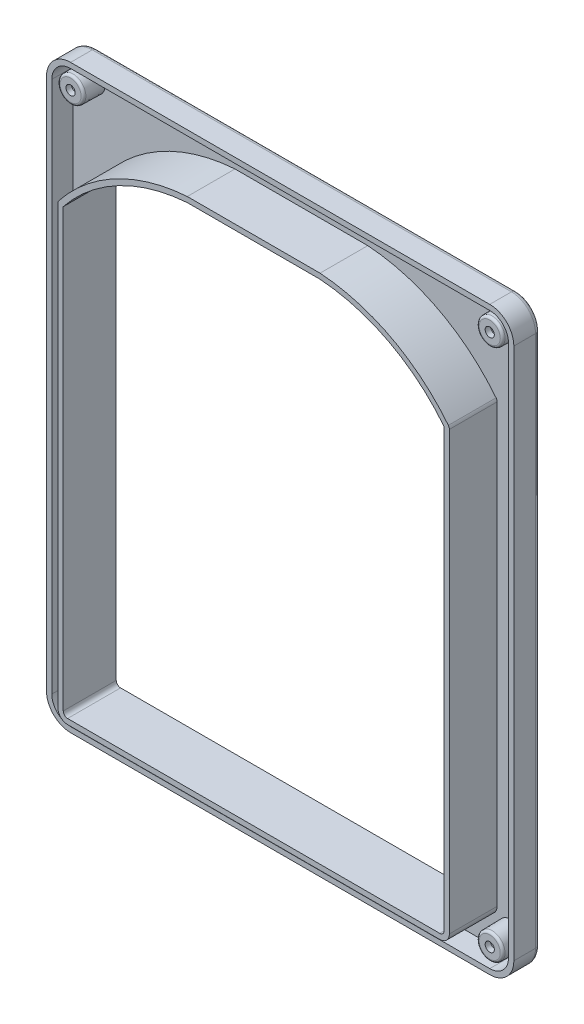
ISO-10303-21;
HEADER;
FILE_DESCRIPTION(('STEP AP214'),'2;1');
FILE_NAME('part.step','',(''),(''),'','','');
FILE_SCHEMA(('AUTOMOTIVE_DESIGN { 1 0 10303 214 1 1 1 1 }'));
ENDSEC;
DATA;
#1=APPLICATION_CONTEXT('core data for automotive mechanical design processes');
#2=APPLICATION_PROTOCOL_DEFINITION('international standard','automotive_design',2000,#1);
#3=PRODUCT_CONTEXT('',#1,'mechanical');
#4=PRODUCT('Part','Part','',(#3));
#5=PRODUCT_RELATED_PRODUCT_CATEGORY('part','',(#4));
#6=PRODUCT_DEFINITION_FORMATION('','',#4);
#7=PRODUCT_DEFINITION_CONTEXT('part definition',#1,'design');
#8=PRODUCT_DEFINITION('design','',#6,#7);
#9=PRODUCT_DEFINITION_SHAPE('','',#8);
#10=(LENGTH_UNIT() NAMED_UNIT(*) SI_UNIT(.MILLI.,.METRE.));
#11=(NAMED_UNIT(*) PLANE_ANGLE_UNIT() SI_UNIT($,.RADIAN.));
#12=(NAMED_UNIT(*) SI_UNIT($,.STERADIAN.) SOLID_ANGLE_UNIT());
#13=UNCERTAINTY_MEASURE_WITH_UNIT(LENGTH_MEASURE(1.E-05),#10,'distance_accuracy_value','');
#14=(GEOMETRIC_REPRESENTATION_CONTEXT(3) GLOBAL_UNCERTAINTY_ASSIGNED_CONTEXT((#13)) GLOBAL_UNIT_ASSIGNED_CONTEXT((#10,
#11,#12)) REPRESENTATION_CONTEXT('',''));
#15=CARTESIAN_POINT('',(0.,0.,0.));
#16=DIRECTION('',(0.,0.,1.));
#17=DIRECTION('',(1.,0.,0.));
#18=AXIS2_PLACEMENT_3D('',#15,#16,#17);
#19=CARTESIAN_POINT('',(87.,-110.65,2.2));
#20=DIRECTION('',(0.,0.,1.));
#21=DIRECTION('',(1.,0.,0.));
#22=AXIS2_PLACEMENT_3D('',#19,#20,#21);
#23=PLANE('',#22);
#24=CARTESIAN_POINT('',(-87.,-110.65,2.2));
#25=DIRECTION('',(0.,0.,1.));
#26=DIRECTION('',(1.,0.,0.));
#27=AXIS2_PLACEMENT_3D('',#24,#25,#26);
#28=CIRCLE('',#27,5.5);
#29=CARTESIAN_POINT('',(-81.5,-110.65,2.2));
#30=VERTEX_POINT('',#29);
#31=EDGE_CURVE('E858',#30,#30,#28,.T.);
#32=ORIENTED_EDGE('',*,*,#31,.F.);
#33=EDGE_LOOP('',(#32));
#34=FACE_BOUND('',#33,.T.);
#35=CARTESIAN_POINT('',(87.,110.35,2.2));
#36=DIRECTION('',(0.,0.,1.));
#37=DIRECTION('',(1.,0.,0.));
#38=AXIS2_PLACEMENT_3D('',#35,#36,#37);
#39=CIRCLE('',#38,5.5);
#40=CARTESIAN_POINT('',(92.5,110.35,2.2));
#41=VERTEX_POINT('',#40);
#42=EDGE_CURVE('E872',#41,#41,#39,.T.);
#43=ORIENTED_EDGE('',*,*,#42,.F.);
#44=EDGE_LOOP('',(#43));
#45=FACE_BOUND('',#44,.T.);
#46=CARTESIAN_POINT('',(87.,-110.65,2.2));
#47=DIRECTION('',(0.,0.,1.));
#48=DIRECTION('',(1.,0.,0.));
#49=AXIS2_PLACEMENT_3D('',#46,#47,#48);
#50=CIRCLE('',#49,7.79999999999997);
#51=CARTESIAN_POINT('',(87.,-118.45,2.2));
#52=VERTEX_POINT('',#51);
#53=CARTESIAN_POINT('',(94.8,-110.65,2.2));
#54=VERTEX_POINT('',#53);
#55=EDGE_CURVE('E899',#52,#54,#50,.T.);
#56=ORIENTED_EDGE('',*,*,#55,.T.);
#57=DIRECTION('',(0.,1.,0.));
#58=VECTOR('',#57,1.);
#59=CARTESIAN_POINT('',(94.8,-110.65,2.2));
#60=LINE('',#59,#58);
#61=CARTESIAN_POINT('',(94.8,110.35,2.2));
#62=VERTEX_POINT('',#61);
#63=EDGE_CURVE('E901',#54,#62,#60,.T.);
#64=ORIENTED_EDGE('',*,*,#63,.T.);
#65=CARTESIAN_POINT('',(87.,110.35,2.2));
#66=DIRECTION('',(0.,0.,1.));
#67=DIRECTION('',(1.,0.,0.));
#68=AXIS2_PLACEMENT_3D('',#65,#66,#67);
#69=CIRCLE('',#68,7.79999999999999);
#70=CARTESIAN_POINT('',(86.9999999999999,118.15,2.2));
#71=VERTEX_POINT('',#70);
#72=EDGE_CURVE('E903',#62,#71,#69,.T.);
#73=ORIENTED_EDGE('',*,*,#72,.T.);
#74=DIRECTION('',(-1.,0.,0.));
#75=VECTOR('',#74,1.);
#76=CARTESIAN_POINT('',(86.9999999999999,118.15,2.2));
#77=LINE('',#76,#75);
#78=CARTESIAN_POINT('',(-87.,118.15,2.2));
#79=VERTEX_POINT('',#78);
#80=EDGE_CURVE('E905',#71,#79,#77,.T.);
#81=ORIENTED_EDGE('',*,*,#80,.T.);
#82=CARTESIAN_POINT('',(-87.,110.35,2.2));
#83=DIRECTION('',(0.,0.,1.));
#84=DIRECTION('',(1.,0.,0.));
#85=AXIS2_PLACEMENT_3D('',#82,#83,#84);
#86=CIRCLE('',#85,7.79999999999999);
#87=CARTESIAN_POINT('',(-94.8,110.35,2.2));
#88=VERTEX_POINT('',#87);
#89=EDGE_CURVE('E907',#79,#88,#86,.T.);
#90=ORIENTED_EDGE('',*,*,#89,.T.);
#91=DIRECTION('',(0.,-1.,0.));
#92=VECTOR('',#91,1.);
#93=CARTESIAN_POINT('',(-94.8,110.35,2.2));
#94=LINE('',#93,#92);
#95=CARTESIAN_POINT('',(-94.8,-110.65,2.2));
#96=VERTEX_POINT('',#95);
#97=EDGE_CURVE('E333',#88,#96,#94,.T.);
#98=ORIENTED_EDGE('',*,*,#97,.T.);
#99=CARTESIAN_POINT('',(-87.,-110.65,2.2));
#100=DIRECTION('',(0.,0.,1.));
#101=DIRECTION('',(1.,0.,0.));
#102=AXIS2_PLACEMENT_3D('',#99,#100,#101);
#103=CIRCLE('',#102,7.79999999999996);
#104=CARTESIAN_POINT('',(-87.,-118.45,2.2));
#105=VERTEX_POINT('',#104);
#106=EDGE_CURVE('E326',#96,#105,#103,.T.);
#107=ORIENTED_EDGE('',*,*,#106,.T.);
#108=DIRECTION('',(1.,0.,0.));
#109=VECTOR('',#108,1.);
#110=CARTESIAN_POINT('',(-87.,-118.45,2.2));
#111=LINE('',#110,#109);
#112=EDGE_CURVE('E330',#105,#52,#111,.T.);
#113=ORIENTED_EDGE('',*,*,#112,.T.);
#114=EDGE_LOOP('',(#56,#64,#73,#81,#90,#98,#107,#113));
#115=FACE_BOUND('',#114,.T.);
#116=CARTESIAN_POINT('',(-79.25,78.0298143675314,2.2));
#117=DIRECTION('',(0.,0.,1.));
#118=DIRECTION('',(1.,0.,0.));
#119=AXIS2_PLACEMENT_3D('',#116,#117,#118);
#120=CIRCLE('',#119,2.00000000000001);
#121=CARTESIAN_POINT('',(-80.8174310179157,79.2720542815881,2.2));
#122=VERTEX_POINT('',#121);
#123=CARTESIAN_POINT('',(-81.25,78.0298143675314,2.2));
#124=VERTEX_POINT('',#123);
#125=EDGE_CURVE('E458',#122,#124,#120,.T.);
#126=ORIENTED_EDGE('',*,*,#125,.F.);
#127=CARTESIAN_POINT('',(-22.3628428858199,32.9448974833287,2.2));
#128=DIRECTION('',(0.,0.,1.));
#129=DIRECTION('',(1.,0.,0.));
#130=AXIS2_PLACEMENT_3D('',#127,#128,#129);
#131=CIRCLE('',#130,74.5864889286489);
#132=CARTESIAN_POINT('',(-27.5614052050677,107.35,2.2));
#133=VERTEX_POINT('',#132);
#134=EDGE_CURVE('E431',#133,#122,#131,.T.);
#135=ORIENTED_EDGE('',*,*,#134,.F.);
#136=DIRECTION('',(-1.,0.,0.));
#137=VECTOR('',#136,1.);
#138=CARTESIAN_POINT('',(-27.5614052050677,107.35,2.2));
#139=LINE('',#138,#137);
#140=CARTESIAN_POINT('',(27.5614052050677,107.35,2.2));
#141=VERTEX_POINT('',#140);
#142=EDGE_CURVE('E434',#141,#133,#139,.T.);
#143=ORIENTED_EDGE('',*,*,#142,.F.);
#144=CARTESIAN_POINT('',(22.3628428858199,32.9448974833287,2.2));
#145=DIRECTION('',(0.,0.,1.));
#146=DIRECTION('',(1.,0.,0.));
#147=AXIS2_PLACEMENT_3D('',#144,#145,#146);
#148=CIRCLE('',#147,74.5864889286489);
#149=CARTESIAN_POINT('',(80.8174310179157,79.2720542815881,2.2));
#150=VERTEX_POINT('',#149);
#151=EDGE_CURVE('E437',#150,#141,#148,.T.);
#152=ORIENTED_EDGE('',*,*,#151,.F.);
#153=CARTESIAN_POINT('',(79.25,78.0298143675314,2.2));
#154=DIRECTION('',(0.,0.,1.));
#155=DIRECTION('',(1.,0.,0.));
#156=AXIS2_PLACEMENT_3D('',#153,#154,#155);
#157=CIRCLE('',#156,2.00000000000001);
#158=CARTESIAN_POINT('',(81.25,78.0298143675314,2.2));
#159=VERTEX_POINT('',#158);
#160=EDGE_CURVE('E440',#159,#150,#157,.T.);
#161=ORIENTED_EDGE('',*,*,#160,.F.);
#162=DIRECTION('',(0.,1.,0.));
#163=VECTOR('',#162,1.);
#164=CARTESIAN_POINT('',(81.25,-103.35,2.2));
#165=LINE('',#164,#163);
#166=CARTESIAN_POINT('',(81.25,-103.35,2.2));
#167=VERTEX_POINT('',#166);
#168=EDGE_CURVE('E443',#167,#159,#165,.T.);
#169=ORIENTED_EDGE('',*,*,#168,.F.);
#170=CARTESIAN_POINT('',(77.25,-103.35,2.2));
#171=DIRECTION('',(0.,0.,1.));
#172=DIRECTION('',(1.,0.,0.));
#173=AXIS2_PLACEMENT_3D('',#170,#171,#172);
#174=CIRCLE('',#173,4.);
#175=CARTESIAN_POINT('',(77.25,-107.35,2.2));
#176=VERTEX_POINT('',#175);
#177=EDGE_CURVE('E446',#176,#167,#174,.T.);
#178=ORIENTED_EDGE('',*,*,#177,.F.);
#179=DIRECTION('',(1.,0.,0.));
#180=VECTOR('',#179,1.);
#181=CARTESIAN_POINT('',(-77.25,-107.35,2.2));
#182=LINE('',#181,#180);
#183=CARTESIAN_POINT('',(-77.25,-107.35,2.2));
#184=VERTEX_POINT('',#183);
#185=EDGE_CURVE('E449',#184,#176,#182,.T.);
#186=ORIENTED_EDGE('',*,*,#185,.F.);
#187=CARTESIAN_POINT('',(-77.25,-103.35,2.2));
#188=DIRECTION('',(0.,0.,1.));
#189=DIRECTION('',(1.,0.,0.));
#190=AXIS2_PLACEMENT_3D('',#187,#188,#189);
#191=CIRCLE('',#190,4.);
#192=CARTESIAN_POINT('',(-81.25,-103.35,2.2));
#193=VERTEX_POINT('',#192);
#194=EDGE_CURVE('E452',#193,#184,#191,.T.);
#195=ORIENTED_EDGE('',*,*,#194,.F.);
#196=DIRECTION('',(0.,-1.,0.));
#197=VECTOR('',#196,1.);
#198=CARTESIAN_POINT('',(-81.25,-103.35,2.2));
#199=LINE('',#198,#197);
#200=EDGE_CURVE('E455',#124,#193,#199,.T.);
#201=ORIENTED_EDGE('',*,*,#200,.F.);
#202=EDGE_LOOP('',(#126,#135,#143,#152,#161,#169,#178,#186,#195,#201));
#203=FACE_BOUND('',#202,.T.);
#204=CARTESIAN_POINT('',(-87.,110.35,2.2));
#205=DIRECTION('',(0.,0.,1.));
#206=DIRECTION('',(1.,0.,0.));
#207=AXIS2_PLACEMENT_3D('',#204,#205,#206);
#208=CIRCLE('',#207,5.5);
#209=CARTESIAN_POINT('',(-81.5,110.35,2.2));
#210=VERTEX_POINT('',#209);
#211=EDGE_CURVE('E850',#210,#210,#208,.T.);
#212=ORIENTED_EDGE('',*,*,#211,.F.);
#213=EDGE_LOOP('',(#212));
#214=FACE_BOUND('',#213,.T.);
#215=CARTESIAN_POINT('',(87.,-110.65,2.2));
#216=DIRECTION('',(0.,0.,1.));
#217=DIRECTION('',(1.,0.,0.));
#218=AXIS2_PLACEMENT_3D('',#215,#216,#217);
#219=CIRCLE('',#218,5.5);
#220=CARTESIAN_POINT('',(92.5,-110.65,2.2));
#221=VERTEX_POINT('',#220);
#222=EDGE_CURVE('E853',#221,#221,#219,.T.);
#223=ORIENTED_EDGE('',*,*,#222,.F.);
#224=EDGE_LOOP('',(#223));
#225=FACE_BOUND('',#224,.T.);
#226=ADVANCED_FACE('F81',(#34,#45,#115,#203,#214,#225),#23,.T.);
#227=CARTESIAN_POINT('',(-79.25,78.0298143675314,22.));
#228=DIRECTION('',(0.,0.,-1.));
#229=DIRECTION('',(-1.,0.,0.));
#230=AXIS2_PLACEMENT_3D('',#227,#228,#229);
#231=PLANE('',#230);
#232=CARTESIAN_POINT('',(-79.25,78.0298143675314,22.));
#233=DIRECTION('',(0.,0.,1.));
#234=DIRECTION('',(-1.,0.,0.));
#235=AXIS2_PLACEMENT_3D('',#232,#233,#234);
#236=CIRCLE('',#235,2.00000000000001);
#237=CARTESIAN_POINT('',(-80.8174310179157,79.2720542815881,22.));
#238=VERTEX_POINT('',#237);
#239=CARTESIAN_POINT('',(-81.25,78.0298143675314,22.));
#240=VERTEX_POINT('',#239);
#241=EDGE_CURVE('E518',#238,#240,#236,.T.);
#242=ORIENTED_EDGE('',*,*,#241,.T.);
#243=DIRECTION('',(0.,-1.,0.));
#244=VECTOR('',#243,1.);
#245=CARTESIAN_POINT('',(-81.25,-103.35,22.));
#246=LINE('',#245,#244);
#247=CARTESIAN_POINT('',(-81.25,-103.35,22.));
#248=VERTEX_POINT('',#247);
#249=EDGE_CURVE('E521',#240,#248,#246,.T.);
#250=ORIENTED_EDGE('',*,*,#249,.T.);
#251=CARTESIAN_POINT('',(-77.25,-103.35,22.));
#252=DIRECTION('',(0.,0.,1.));
#253=DIRECTION('',(1.,0.,0.));
#254=AXIS2_PLACEMENT_3D('',#251,#252,#253);
#255=CIRCLE('',#254,4.);
#256=CARTESIAN_POINT('',(-77.25,-107.35,22.));
#257=VERTEX_POINT('',#256);
#258=EDGE_CURVE('E523',#248,#257,#255,.T.);
#259=ORIENTED_EDGE('',*,*,#258,.T.);
#260=DIRECTION('',(1.,0.,0.));
#261=VECTOR('',#260,1.);
#262=CARTESIAN_POINT('',(-77.25,-107.35,22.));
#263=LINE('',#262,#261);
#264=CARTESIAN_POINT('',(77.25,-107.35,22.));
#265=VERTEX_POINT('',#264);
#266=EDGE_CURVE('E525',#257,#265,#263,.T.);
#267=ORIENTED_EDGE('',*,*,#266,.T.);
#268=CARTESIAN_POINT('',(77.25,-103.35,22.));
#269=DIRECTION('',(0.,0.,1.));
#270=DIRECTION('',(-1.,0.,0.));
#271=AXIS2_PLACEMENT_3D('',#268,#269,#270);
#272=CIRCLE('',#271,4.);
#273=CARTESIAN_POINT('',(81.25,-103.35,22.));
#274=VERTEX_POINT('',#273);
#275=EDGE_CURVE('E527',#265,#274,#272,.T.);
#276=ORIENTED_EDGE('',*,*,#275,.T.);
#277=DIRECTION('',(0.,1.,0.));
#278=VECTOR('',#277,1.);
#279=CARTESIAN_POINT('',(81.25,-103.35,22.));
#280=LINE('',#279,#278);
#281=CARTESIAN_POINT('',(81.25,78.0298143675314,22.));
#282=VERTEX_POINT('',#281);
#283=EDGE_CURVE('E529',#274,#282,#280,.T.);
#284=ORIENTED_EDGE('',*,*,#283,.T.);
#285=CARTESIAN_POINT('',(79.25,78.0298143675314,22.));
#286=DIRECTION('',(0.,0.,1.));
#287=DIRECTION('',(1.,0.,0.));
#288=AXIS2_PLACEMENT_3D('',#285,#286,#287);
#289=CIRCLE('',#288,2.00000000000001);
#290=CARTESIAN_POINT('',(80.8174310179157,79.2720542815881,22.));
#291=VERTEX_POINT('',#290);
#292=EDGE_CURVE('E531',#282,#291,#289,.T.);
#293=ORIENTED_EDGE('',*,*,#292,.T.);
#294=CARTESIAN_POINT('',(22.3628428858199,32.9448974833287,22.));
#295=DIRECTION('',(0.,0.,1.));
#296=DIRECTION('',(1.,0.,0.));
#297=AXIS2_PLACEMENT_3D('',#294,#295,#296);
#298=CIRCLE('',#297,74.5864889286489);
#299=CARTESIAN_POINT('',(27.5614052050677,107.35,22.));
#300=VERTEX_POINT('',#299);
#301=EDGE_CURVE('E533',#291,#300,#298,.T.);
#302=ORIENTED_EDGE('',*,*,#301,.T.);
#303=DIRECTION('',(-1.,0.,0.));
#304=VECTOR('',#303,1.);
#305=CARTESIAN_POINT('',(-27.5614052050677,107.35,22.));
#306=LINE('',#305,#304);
#307=CARTESIAN_POINT('',(-27.5614052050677,107.35,22.));
#308=VERTEX_POINT('',#307);
#309=EDGE_CURVE('E535',#300,#308,#306,.T.);
#310=ORIENTED_EDGE('',*,*,#309,.T.);
#311=CARTESIAN_POINT('',(-22.3628428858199,32.9448974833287,22.));
#312=DIRECTION('',(0.,0.,1.));
#313=DIRECTION('',(-1.,0.,0.));
#314=AXIS2_PLACEMENT_3D('',#311,#312,#313);
#315=CIRCLE('',#314,74.5864889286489);
#316=EDGE_CURVE('E537',#308,#238,#315,.T.);
#317=ORIENTED_EDGE('',*,*,#316,.T.);
#318=EDGE_LOOP('',(#242,#250,#259,#267,#276,#284,#293,#302,#310,#317));
#319=FACE_BOUND('',#318,.T.);
#320=CARTESIAN_POINT('',(-77.25,-103.35,22.));
#321=DIRECTION('',(0.,0.,1.));
#322=DIRECTION('',(1.,0.,0.));
#323=AXIS2_PLACEMENT_3D('',#320,#321,#322);
#324=CIRCLE('',#323,1.80000000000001);
#325=CARTESIAN_POINT('',(-79.05,-103.35,22.));
#326=VERTEX_POINT('',#325);
#327=CARTESIAN_POINT('',(-77.25,-105.15,22.));
#328=VERTEX_POINT('',#327);
#329=EDGE_CURVE('E485',#326,#328,#324,.T.);
#330=ORIENTED_EDGE('',*,*,#329,.F.);
#331=DIRECTION('',(0.,-1.,0.));
#332=VECTOR('',#331,1.);
#333=CARTESIAN_POINT('',(-79.05,-103.35,22.));
#334=LINE('',#333,#332);
#335=CARTESIAN_POINT('',(-79.05,77.9601171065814,22.));
#336=VERTEX_POINT('',#335);
#337=EDGE_CURVE('E500',#336,#326,#334,.T.);
#338=ORIENTED_EDGE('',*,*,#337,.F.);
#339=CARTESIAN_POINT('',(-22.3628428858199,32.9448974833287,22.));
#340=DIRECTION('',(0.,0.,1.));
#341=DIRECTION('',(-1.,0.,0.));
#342=AXIS2_PLACEMENT_3D('',#339,#340,#341);
#343=CIRCLE('',#342,72.3864889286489);
#344=CARTESIAN_POINT('',(-27.4840683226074,105.15,22.));
#345=VERTEX_POINT('',#344);
#346=EDGE_CURVE('E497',#345,#336,#343,.T.);
#347=ORIENTED_EDGE('',*,*,#346,.F.);
#348=DIRECTION('',(-1.,0.,0.));
#349=VECTOR('',#348,1.);
#350=CARTESIAN_POINT('',(-27.4840683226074,105.15,22.));
#351=LINE('',#350,#349);
#352=CARTESIAN_POINT('',(27.4840683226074,105.15,22.));
#353=VERTEX_POINT('',#352);
#354=EDGE_CURVE('E495',#353,#345,#351,.T.);
#355=ORIENTED_EDGE('',*,*,#354,.F.);
#356=CARTESIAN_POINT('',(22.3628428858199,32.9448974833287,22.));
#357=DIRECTION('',(0.,0.,1.));
#358=DIRECTION('',(1.,0.,0.));
#359=AXIS2_PLACEMENT_3D('',#356,#357,#358);
#360=CIRCLE('',#359,72.3864889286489);
#361=CARTESIAN_POINT('',(79.05,77.9601171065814,22.));
#362=VERTEX_POINT('',#361);
#363=EDGE_CURVE('E493',#362,#353,#360,.T.);
#364=ORIENTED_EDGE('',*,*,#363,.F.);
#365=DIRECTION('',(0.,1.,0.));
#366=VECTOR('',#365,1.);
#367=CARTESIAN_POINT('',(79.05,-103.35,22.));
#368=LINE('',#367,#366);
#369=CARTESIAN_POINT('',(79.05,-103.35,22.));
#370=VERTEX_POINT('',#369);
#371=EDGE_CURVE('E491',#370,#362,#368,.T.);
#372=ORIENTED_EDGE('',*,*,#371,.F.);
#373=CARTESIAN_POINT('',(77.25,-103.35,22.));
#374=DIRECTION('',(0.,0.,1.));
#375=DIRECTION('',(-1.,0.,0.));
#376=AXIS2_PLACEMENT_3D('',#373,#374,#375);
#377=CIRCLE('',#376,1.80000000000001);
#378=CARTESIAN_POINT('',(77.25,-105.15,22.));
#379=VERTEX_POINT('',#378);
#380=EDGE_CURVE('E489',#379,#370,#377,.T.);
#381=ORIENTED_EDGE('',*,*,#380,.F.);
#382=DIRECTION('',(1.,0.,0.));
#383=VECTOR('',#382,1.);
#384=CARTESIAN_POINT('',(-77.25,-105.15,22.));
#385=LINE('',#384,#383);
#386=EDGE_CURVE('E487',#328,#379,#385,.T.);
#387=ORIENTED_EDGE('',*,*,#386,.F.);
#388=EDGE_LOOP('',(#330,#338,#347,#355,#364,#372,#381,#387));
#389=FACE_BOUND('',#388,.T.);
#390=ADVANCED_FACE('F682',(#319,#389),#231,.F.);
#391=CARTESIAN_POINT('',(-79.25,78.0298143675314,0.));
#392=DIRECTION('',(0.,0.,-1.));
#393=DIRECTION('',(-1.,0.,0.));
#394=AXIS2_PLACEMENT_3D('',#391,#392,#393);
#395=PLANE('',#394);
#396=CARTESIAN_POINT('',(-87.,110.35,0.));
#397=DIRECTION('',(0.,0.,-1.));
#398=DIRECTION('',(-1.,0.,0.));
#399=AXIS2_PLACEMENT_3D('',#396,#397,#398);
#400=CIRCLE('',#399,4.175);
#401=CARTESIAN_POINT('',(-91.175,110.35,0.));
#402=VERTEX_POINT('',#401);
#403=EDGE_CURVE('E654',#402,#402,#400,.F.);
#404=ORIENTED_EDGE('',*,*,#403,.T.);
#405=EDGE_LOOP('',(#404));
#406=FACE_BOUND('',#405,.T.);
#407=CARTESIAN_POINT('',(-87.,-110.65,0.));
#408=DIRECTION('',(0.,0.,-1.));
#409=DIRECTION('',(-1.,0.,0.));
#410=AXIS2_PLACEMENT_3D('',#407,#408,#409);
#411=CIRCLE('',#410,4.175);
#412=CARTESIAN_POINT('',(-91.175,-110.65,0.));
#413=VERTEX_POINT('',#412);
#414=EDGE_CURVE('E651',#413,#413,#411,.F.);
#415=ORIENTED_EDGE('',*,*,#414,.T.);
#416=EDGE_LOOP('',(#415));
#417=FACE_BOUND('',#416,.T.);
#418=CARTESIAN_POINT('',(87.,-110.65,0.));
#419=DIRECTION('',(0.,0.,-1.));
#420=DIRECTION('',(-1.,0.,0.));
#421=AXIS2_PLACEMENT_3D('',#418,#419,#420);
#422=CIRCLE('',#421,4.175);
#423=CARTESIAN_POINT('',(82.825,-110.65,0.));
#424=VERTEX_POINT('',#423);
#425=EDGE_CURVE('E648',#424,#424,#422,.F.);
#426=ORIENTED_EDGE('',*,*,#425,.T.);
#427=EDGE_LOOP('',(#426));
#428=FACE_BOUND('',#427,.T.);
#429=CARTESIAN_POINT('',(87.,110.35,0.));
#430=DIRECTION('',(0.,0.,-1.));
#431=DIRECTION('',(-1.,0.,0.));
#432=AXIS2_PLACEMENT_3D('',#429,#430,#431);
#433=CIRCLE('',#432,4.175);
#434=CARTESIAN_POINT('',(82.825,110.35,0.));
#435=VERTEX_POINT('',#434);
#436=EDGE_CURVE('E645',#435,#435,#433,.F.);
#437=ORIENTED_EDGE('',*,*,#436,.T.);
#438=EDGE_LOOP('',(#437));
#439=FACE_BOUND('',#438,.T.);
#440=DIRECTION('',(-1.,0.,0.));
#441=VECTOR('',#440,1.);
#442=CARTESIAN_POINT('',(86.9999999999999,118.35,0.));
#443=LINE('',#442,#441);
#444=CARTESIAN_POINT('',(-87.,118.35,0.));
#445=VERTEX_POINT('',#444);
#446=CARTESIAN_POINT('',(86.9999999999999,118.35,0.));
#447=VERTEX_POINT('',#446);
#448=EDGE_CURVE('E572',#445,#447,#443,.F.);
#449=ORIENTED_EDGE('',*,*,#448,.T.);
#450=CARTESIAN_POINT('',(87.,110.35,0.));
#451=DIRECTION('',(0.,0.,-1.));
#452=DIRECTION('',(-1.,0.,0.));
#453=AXIS2_PLACEMENT_3D('',#450,#451,#452);
#454=CIRCLE('',#453,7.99999999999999);
#455=CARTESIAN_POINT('',(95.,110.35,0.));
#456=VERTEX_POINT('',#455);
#457=EDGE_CURVE('E586',#447,#456,#454,.T.);
#458=ORIENTED_EDGE('',*,*,#457,.T.);
#459=DIRECTION('',(0.,1.,0.));
#460=VECTOR('',#459,1.);
#461=CARTESIAN_POINT('',(95.,-110.65,0.));
#462=LINE('',#461,#460);
#463=CARTESIAN_POINT('',(95.,-110.65,0.));
#464=VERTEX_POINT('',#463);
#465=EDGE_CURVE('E584',#456,#464,#462,.F.);
#466=ORIENTED_EDGE('',*,*,#465,.T.);
#467=CARTESIAN_POINT('',(87.,-110.65,0.));
#468=DIRECTION('',(0.,0.,-1.));
#469=DIRECTION('',(-1.,0.,0.));
#470=AXIS2_PLACEMENT_3D('',#467,#468,#469);
#471=CIRCLE('',#470,7.99999999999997);
#472=CARTESIAN_POINT('',(87.,-118.65,0.));
#473=VERTEX_POINT('',#472);
#474=EDGE_CURVE('E582',#464,#473,#471,.T.);
#475=ORIENTED_EDGE('',*,*,#474,.T.);
#476=DIRECTION('',(1.,0.,0.));
#477=VECTOR('',#476,1.);
#478=CARTESIAN_POINT('',(-87.,-118.65,0.));
#479=LINE('',#478,#477);
#480=CARTESIAN_POINT('',(-87.,-118.65,0.));
#481=VERTEX_POINT('',#480);
#482=EDGE_CURVE('E580',#473,#481,#479,.F.);
#483=ORIENTED_EDGE('',*,*,#482,.T.);
#484=CARTESIAN_POINT('',(-87.,-110.65,0.));
#485=DIRECTION('',(0.,0.,-1.));
#486=DIRECTION('',(-1.,0.,0.));
#487=AXIS2_PLACEMENT_3D('',#484,#485,#486);
#488=CIRCLE('',#487,7.99999999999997);
#489=CARTESIAN_POINT('',(-95.,-110.65,0.));
#490=VERTEX_POINT('',#489);
#491=EDGE_CURVE('E578',#481,#490,#488,.T.);
#492=ORIENTED_EDGE('',*,*,#491,.T.);
#493=DIRECTION('',(0.,-1.,0.));
#494=VECTOR('',#493,1.);
#495=CARTESIAN_POINT('',(-95.,110.35,0.));
#496=LINE('',#495,#494);
#497=CARTESIAN_POINT('',(-95.,110.35,0.));
#498=VERTEX_POINT('',#497);
#499=EDGE_CURVE('E576',#490,#498,#496,.F.);
#500=ORIENTED_EDGE('',*,*,#499,.T.);
#501=CARTESIAN_POINT('',(-87.,110.35,0.));
#502=DIRECTION('',(0.,0.,-1.));
#503=DIRECTION('',(-1.,0.,0.));
#504=AXIS2_PLACEMENT_3D('',#501,#502,#503);
#505=CIRCLE('',#504,8.);
#506=EDGE_CURVE('E574',#498,#445,#505,.T.);
#507=ORIENTED_EDGE('',*,*,#506,.T.);
#508=EDGE_LOOP('',(#449,#458,#466,#475,#483,#492,#500,#507));
#509=FACE_BOUND('',#508,.T.);
#510=DIRECTION('',(0.,-1.,0.));
#511=VECTOR('',#510,1.);
#512=CARTESIAN_POINT('',(-79.05,-103.35,0.));
#513=LINE('',#512,#511);
#514=CARTESIAN_POINT('',(-79.05,77.9601171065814,0.));
#515=VERTEX_POINT('',#514);
#516=CARTESIAN_POINT('',(-79.05,-103.35,0.));
#517=VERTEX_POINT('',#516);
#518=EDGE_CURVE('E482',#515,#517,#513,.T.);
#519=ORIENTED_EDGE('',*,*,#518,.T.);
#520=CARTESIAN_POINT('',(-77.25,-103.35,0.));
#521=DIRECTION('',(0.,0.,1.));
#522=DIRECTION('',(1.,0.,0.));
#523=AXIS2_PLACEMENT_3D('',#520,#521,#522);
#524=CIRCLE('',#523,1.80000000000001);
#525=CARTESIAN_POINT('',(-77.25,-105.15,0.));
#526=VERTEX_POINT('',#525);
#527=EDGE_CURVE('E461',#517,#526,#524,.T.);
#528=ORIENTED_EDGE('',*,*,#527,.T.);
#529=DIRECTION('',(1.,0.,0.));
#530=VECTOR('',#529,1.);
#531=CARTESIAN_POINT('',(-77.25,-105.15,0.));
#532=LINE('',#531,#530);
#533=CARTESIAN_POINT('',(77.25,-105.15,0.));
#534=VERTEX_POINT('',#533);
#535=EDGE_CURVE('E464',#526,#534,#532,.T.);
#536=ORIENTED_EDGE('',*,*,#535,.T.);
#537=CARTESIAN_POINT('',(77.25,-103.35,0.));
#538=DIRECTION('',(0.,0.,1.));
#539=DIRECTION('',(-1.,0.,0.));
#540=AXIS2_PLACEMENT_3D('',#537,#538,#539);
#541=CIRCLE('',#540,1.80000000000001);
#542=CARTESIAN_POINT('',(79.05,-103.35,0.));
#543=VERTEX_POINT('',#542);
#544=EDGE_CURVE('E467',#534,#543,#541,.T.);
#545=ORIENTED_EDGE('',*,*,#544,.T.);
#546=DIRECTION('',(0.,1.,0.));
#547=VECTOR('',#546,1.);
#548=CARTESIAN_POINT('',(79.05,-103.35,0.));
#549=LINE('',#548,#547);
#550=CARTESIAN_POINT('',(79.05,77.9601171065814,0.));
#551=VERTEX_POINT('',#550);
#552=EDGE_CURVE('E470',#543,#551,#549,.T.);
#553=ORIENTED_EDGE('',*,*,#552,.T.);
#554=CARTESIAN_POINT('',(22.3628428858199,32.9448974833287,0.));
#555=DIRECTION('',(0.,0.,1.));
#556=DIRECTION('',(1.,0.,0.));
#557=AXIS2_PLACEMENT_3D('',#554,#555,#556);
#558=CIRCLE('',#557,72.3864889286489);
#559=CARTESIAN_POINT('',(27.4840683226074,105.15,0.));
#560=VERTEX_POINT('',#559);
#561=EDGE_CURVE('E473',#551,#560,#558,.T.);
#562=ORIENTED_EDGE('',*,*,#561,.T.);
#563=DIRECTION('',(-1.,0.,0.));
#564=VECTOR('',#563,1.);
#565=CARTESIAN_POINT('',(-27.4840683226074,105.15,0.));
#566=LINE('',#565,#564);
#567=CARTESIAN_POINT('',(-27.4840683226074,105.15,0.));
#568=VERTEX_POINT('',#567);
#569=EDGE_CURVE('E476',#560,#568,#566,.T.);
#570=ORIENTED_EDGE('',*,*,#569,.T.);
#571=CARTESIAN_POINT('',(-22.3628428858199,32.9448974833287,0.));
#572=DIRECTION('',(0.,0.,1.));
#573=DIRECTION('',(-1.,0.,0.));
#574=AXIS2_PLACEMENT_3D('',#571,#572,#573);
#575=CIRCLE('',#574,72.3864889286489);
#576=EDGE_CURVE('E479',#568,#515,#575,.T.);
#577=ORIENTED_EDGE('',*,*,#576,.T.);
#578=EDGE_LOOP('',(#519,#528,#536,#545,#553,#562,#570,#577));
#579=FACE_BOUND('',#578,.T.);
#580=ADVANCED_FACE('F690',(#406,#417,#428,#439,#509,#579),#395,.T.);
#581=CARTESIAN_POINT('',(-79.25,78.0298143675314,22.));
#582=DIRECTION('',(0.,0.,-1.));
#583=DIRECTION('',(-1.,0.,0.));
#584=AXIS2_PLACEMENT_3D('',#581,#582,#583);
#585=CYLINDRICAL_SURFACE('',#584,2.00000000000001);
#586=DIRECTION('',(0.,0.,-1.));
#587=VECTOR('',#586,1.);
#588=CARTESIAN_POINT('',(-80.8174310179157,79.2720542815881,22.));
#589=LINE('',#588,#587);
#590=EDGE_CURVE('E539',#238,#122,#589,.T.);
#591=ORIENTED_EDGE('',*,*,#590,.T.);
#592=ORIENTED_EDGE('',*,*,#125,.T.);
#593=DIRECTION('',(0.,0.,-1.));
#594=VECTOR('',#593,1.);
#595=CARTESIAN_POINT('',(-81.25,78.0298143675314,22.));
#596=LINE('',#595,#594);
#597=EDGE_CURVE('E566',#240,#124,#596,.T.);
#598=ORIENTED_EDGE('',*,*,#597,.F.);
#599=ORIENTED_EDGE('',*,*,#241,.F.);
#600=EDGE_LOOP('',(#591,#592,#598,#599));
#601=FACE_BOUND('',#600,.T.);
#602=ADVANCED_FACE('F83',(#601),#585,.T.);
#603=CARTESIAN_POINT('',(-81.25,-103.35,22.));
#604=DIRECTION('',(1.,0.,0.));
#605=DIRECTION('',(0.,0.,-1.));
#606=AXIS2_PLACEMENT_3D('',#603,#604,#605);
#607=PLANE('',#606);
#608=ORIENTED_EDGE('',*,*,#597,.T.);
#609=ORIENTED_EDGE('',*,*,#200,.T.);
#610=DIRECTION('',(0.,0.,-1.));
#611=VECTOR('',#610,1.);
#612=CARTESIAN_POINT('',(-81.25,-103.35,22.));
#613=LINE('',#612,#611);
#614=EDGE_CURVE('E563',#248,#193,#613,.T.);
#615=ORIENTED_EDGE('',*,*,#614,.F.);
#616=ORIENTED_EDGE('',*,*,#249,.F.);
#617=EDGE_LOOP('',(#608,#609,#615,#616));
#618=FACE_BOUND('',#617,.T.);
#619=ADVANCED_FACE('F794',(#618),#607,.F.);
#620=CARTESIAN_POINT('',(-77.25,-103.35,22.));
#621=DIRECTION('',(0.,0.,-1.));
#622=DIRECTION('',(-1.,0.,0.));
#623=AXIS2_PLACEMENT_3D('',#620,#621,#622);
#624=CYLINDRICAL_SURFACE('',#623,4.);
#625=ORIENTED_EDGE('',*,*,#614,.T.);
#626=ORIENTED_EDGE('',*,*,#194,.T.);
#627=DIRECTION('',(0.,0.,-1.));
#628=VECTOR('',#627,1.);
#629=CARTESIAN_POINT('',(-77.25,-107.35,22.));
#630=LINE('',#629,#628);
#631=EDGE_CURVE('E560',#257,#184,#630,.T.);
#632=ORIENTED_EDGE('',*,*,#631,.F.);
#633=ORIENTED_EDGE('',*,*,#258,.F.);
#634=EDGE_LOOP('',(#625,#626,#632,#633));
#635=FACE_BOUND('',#634,.T.);
#636=ADVANCED_FACE('F791',(#635),#624,.T.);
#637=CARTESIAN_POINT('',(-77.25,-107.35,22.));
#638=DIRECTION('',(0.,1.,0.));
#639=DIRECTION('',(0.,0.,1.));
#640=AXIS2_PLACEMENT_3D('',#637,#638,#639);
#641=PLANE('',#640);
#642=ORIENTED_EDGE('',*,*,#631,.T.);
#643=ORIENTED_EDGE('',*,*,#185,.T.);
#644=DIRECTION('',(0.,0.,-1.));
#645=VECTOR('',#644,1.);
#646=CARTESIAN_POINT('',(77.25,-107.35,22.));
#647=LINE('',#646,#645);
#648=EDGE_CURVE('E557',#265,#176,#647,.T.);
#649=ORIENTED_EDGE('',*,*,#648,.F.);
#650=ORIENTED_EDGE('',*,*,#266,.F.);
#651=EDGE_LOOP('',(#642,#643,#649,#650));
#652=FACE_BOUND('',#651,.T.);
#653=ADVANCED_FACE('F787',(#652),#641,.F.);
#654=CARTESIAN_POINT('',(77.25,-103.35,22.));
#655=DIRECTION('',(0.,0.,-1.));
#656=DIRECTION('',(-1.,0.,0.));
#657=AXIS2_PLACEMENT_3D('',#654,#655,#656);
#658=CYLINDRICAL_SURFACE('',#657,4.);
#659=ORIENTED_EDGE('',*,*,#648,.T.);
#660=ORIENTED_EDGE('',*,*,#177,.T.);
#661=DIRECTION('',(0.,0.,-1.));
#662=VECTOR('',#661,1.);
#663=CARTESIAN_POINT('',(81.25,-103.35,22.));
#664=LINE('',#663,#662);
#665=EDGE_CURVE('E554',#274,#167,#664,.T.);
#666=ORIENTED_EDGE('',*,*,#665,.F.);
#667=ORIENTED_EDGE('',*,*,#275,.F.);
#668=EDGE_LOOP('',(#659,#660,#666,#667));
#669=FACE_BOUND('',#668,.T.);
#670=ADVANCED_FACE('F783',(#669),#658,.T.);
#671=CARTESIAN_POINT('',(81.25,-103.35,22.));
#672=DIRECTION('',(-1.,0.,0.));
#673=DIRECTION('',(0.,0.,1.));
#674=AXIS2_PLACEMENT_3D('',#671,#672,#673);
#675=PLANE('',#674);
#676=ORIENTED_EDGE('',*,*,#665,.T.);
#677=ORIENTED_EDGE('',*,*,#168,.T.);
#678=DIRECTION('',(0.,0.,-1.));
#679=VECTOR('',#678,1.);
#680=CARTESIAN_POINT('',(81.25,78.0298143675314,22.));
#681=LINE('',#680,#679);
#682=EDGE_CURVE('E551',#282,#159,#681,.T.);
#683=ORIENTED_EDGE('',*,*,#682,.F.);
#684=ORIENTED_EDGE('',*,*,#283,.F.);
#685=EDGE_LOOP('',(#676,#677,#683,#684));
#686=FACE_BOUND('',#685,.T.);
#687=ADVANCED_FACE('F779',(#686),#675,.F.);
#688=CARTESIAN_POINT('',(79.25,78.0298143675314,22.));
#689=DIRECTION('',(0.,0.,-1.));
#690=DIRECTION('',(-1.,0.,0.));
#691=AXIS2_PLACEMENT_3D('',#688,#689,#690);
#692=CYLINDRICAL_SURFACE('',#691,2.00000000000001);
#693=ORIENTED_EDGE('',*,*,#682,.T.);
#694=ORIENTED_EDGE('',*,*,#160,.T.);
#695=DIRECTION('',(0.,0.,-1.));
#696=VECTOR('',#695,1.);
#697=CARTESIAN_POINT('',(80.8174310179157,79.2720542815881,22.));
#698=LINE('',#697,#696);
#699=EDGE_CURVE('E548',#291,#150,#698,.T.);
#700=ORIENTED_EDGE('',*,*,#699,.F.);
#701=ORIENTED_EDGE('',*,*,#292,.F.);
#702=EDGE_LOOP('',(#693,#694,#700,#701));
#703=FACE_BOUND('',#702,.T.);
#704=ADVANCED_FACE('F775',(#703),#692,.T.);
#705=CARTESIAN_POINT('',(22.3628428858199,32.9448974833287,22.));
#706=DIRECTION('',(0.,0.,-1.));
#707=DIRECTION('',(-1.,0.,0.));
#708=AXIS2_PLACEMENT_3D('',#705,#706,#707);
#709=CYLINDRICAL_SURFACE('',#708,74.5864889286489);
#710=ORIENTED_EDGE('',*,*,#699,.T.);
#711=ORIENTED_EDGE('',*,*,#151,.T.);
#712=DIRECTION('',(0.,0.,-1.));
#713=VECTOR('',#712,1.);
#714=CARTESIAN_POINT('',(27.5614052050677,107.35,22.));
#715=LINE('',#714,#713);
#716=EDGE_CURVE('E545',#300,#141,#715,.T.);
#717=ORIENTED_EDGE('',*,*,#716,.F.);
#718=ORIENTED_EDGE('',*,*,#301,.F.);
#719=EDGE_LOOP('',(#710,#711,#717,#718));
#720=FACE_BOUND('',#719,.T.);
#721=ADVANCED_FACE('F771',(#720),#709,.T.);
#722=CARTESIAN_POINT('',(-27.5614052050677,107.35,22.));
#723=DIRECTION('',(0.,-1.,0.));
#724=DIRECTION('',(0.,0.,-1.));
#725=AXIS2_PLACEMENT_3D('',#722,#723,#724);
#726=PLANE('',#725);
#727=ORIENTED_EDGE('',*,*,#716,.T.);
#728=ORIENTED_EDGE('',*,*,#142,.T.);
#729=DIRECTION('',(0.,0.,-1.));
#730=VECTOR('',#729,1.);
#731=CARTESIAN_POINT('',(-27.5614052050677,107.35,22.));
#732=LINE('',#731,#730);
#733=EDGE_CURVE('E542',#308,#133,#732,.T.);
#734=ORIENTED_EDGE('',*,*,#733,.F.);
#735=ORIENTED_EDGE('',*,*,#309,.F.);
#736=EDGE_LOOP('',(#727,#728,#734,#735));
#737=FACE_BOUND('',#736,.T.);
#738=ADVANCED_FACE('F767',(#737),#726,.F.);
#739=CARTESIAN_POINT('',(-22.3628428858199,32.9448974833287,22.));
#740=DIRECTION('',(0.,0.,-1.));
#741=DIRECTION('',(-1.,0.,0.));
#742=AXIS2_PLACEMENT_3D('',#739,#740,#741);
#743=CYLINDRICAL_SURFACE('',#742,74.5864889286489);
#744=ORIENTED_EDGE('',*,*,#733,.T.);
#745=ORIENTED_EDGE('',*,*,#134,.T.);
#746=ORIENTED_EDGE('',*,*,#590,.F.);
#747=ORIENTED_EDGE('',*,*,#316,.F.);
#748=EDGE_LOOP('',(#744,#745,#746,#747));
#749=FACE_BOUND('',#748,.T.);
#750=ADVANCED_FACE('F760',(#749),#743,.T.);
#751=CARTESIAN_POINT('',(-77.25,-103.35,22.));
#752=DIRECTION('',(0.,0.,-1.));
#753=DIRECTION('',(-1.,0.,0.));
#754=AXIS2_PLACEMENT_3D('',#751,#752,#753);
#755=CYLINDRICAL_SURFACE('',#754,1.80000000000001);
#756=DIRECTION('',(0.,0.,-1.));
#757=VECTOR('',#756,1.);
#758=CARTESIAN_POINT('',(-77.25,-105.15,22.));
#759=LINE('',#758,#757);
#760=EDGE_CURVE('E516',#328,#526,#759,.T.);
#761=ORIENTED_EDGE('',*,*,#760,.T.);
#762=ORIENTED_EDGE('',*,*,#527,.F.);
#763=DIRECTION('',(0.,0.,-1.));
#764=VECTOR('',#763,1.);
#765=CARTESIAN_POINT('',(-79.05,-103.35,22.));
#766=LINE('',#765,#764);
#767=EDGE_CURVE('E502',#326,#517,#766,.T.);
#768=ORIENTED_EDGE('',*,*,#767,.F.);
#769=ORIENTED_EDGE('',*,*,#329,.T.);
#770=EDGE_LOOP('',(#761,#762,#768,#769));
#771=FACE_BOUND('',#770,.T.);
#772=ADVANCED_FACE('F756',(#771),#755,.F.);
#773=CARTESIAN_POINT('',(-77.25,-105.15,22.));
#774=DIRECTION('',(0.,1.,0.));
#775=DIRECTION('',(0.,0.,1.));
#776=AXIS2_PLACEMENT_3D('',#773,#774,#775);
#777=PLANE('',#776);
#778=DIRECTION('',(0.,0.,-1.));
#779=VECTOR('',#778,1.);
#780=CARTESIAN_POINT('',(77.25,-105.15,22.));
#781=LINE('',#780,#779);
#782=EDGE_CURVE('E514',#379,#534,#781,.T.);
#783=ORIENTED_EDGE('',*,*,#782,.T.);
#784=ORIENTED_EDGE('',*,*,#535,.F.);
#785=ORIENTED_EDGE('',*,*,#760,.F.);
#786=ORIENTED_EDGE('',*,*,#386,.T.);
#787=EDGE_LOOP('',(#783,#784,#785,#786));
#788=FACE_BOUND('',#787,.T.);
#789=ADVANCED_FACE('F752',(#788),#777,.T.);
#790=CARTESIAN_POINT('',(77.25,-103.35,22.));
#791=DIRECTION('',(0.,0.,-1.));
#792=DIRECTION('',(-1.,0.,0.));
#793=AXIS2_PLACEMENT_3D('',#790,#791,#792);
#794=CYLINDRICAL_SURFACE('',#793,1.80000000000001);
#795=DIRECTION('',(0.,0.,-1.));
#796=VECTOR('',#795,1.);
#797=CARTESIAN_POINT('',(79.05,-103.35,22.));
#798=LINE('',#797,#796);
#799=EDGE_CURVE('E512',#370,#543,#798,.T.);
#800=ORIENTED_EDGE('',*,*,#799,.T.);
#801=ORIENTED_EDGE('',*,*,#544,.F.);
#802=ORIENTED_EDGE('',*,*,#782,.F.);
#803=ORIENTED_EDGE('',*,*,#380,.T.);
#804=EDGE_LOOP('',(#800,#801,#802,#803));
#805=FACE_BOUND('',#804,.T.);
#806=ADVANCED_FACE('F748',(#805),#794,.F.);
#807=CARTESIAN_POINT('',(79.05,-103.35,22.));
#808=DIRECTION('',(-1.,0.,0.));
#809=DIRECTION('',(0.,0.,1.));
#810=AXIS2_PLACEMENT_3D('',#807,#808,#809);
#811=PLANE('',#810);
#812=DIRECTION('',(0.,0.,-1.));
#813=VECTOR('',#812,1.);
#814=CARTESIAN_POINT('',(79.05,77.9601171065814,22.));
#815=LINE('',#814,#813);
#816=EDGE_CURVE('E510',#362,#551,#815,.T.);
#817=ORIENTED_EDGE('',*,*,#816,.T.);
#818=ORIENTED_EDGE('',*,*,#552,.F.);
#819=ORIENTED_EDGE('',*,*,#799,.F.);
#820=ORIENTED_EDGE('',*,*,#371,.T.);
#821=EDGE_LOOP('',(#817,#818,#819,#820));
#822=FACE_BOUND('',#821,.T.);
#823=ADVANCED_FACE('F744',(#822),#811,.T.);
#824=CARTESIAN_POINT('',(22.3628428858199,32.9448974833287,22.));
#825=DIRECTION('',(0.,0.,-1.));
#826=DIRECTION('',(-1.,0.,0.));
#827=AXIS2_PLACEMENT_3D('',#824,#825,#826);
#828=CYLINDRICAL_SURFACE('',#827,72.3864889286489);
#829=DIRECTION('',(0.,0.,-1.));
#830=VECTOR('',#829,1.);
#831=CARTESIAN_POINT('',(27.4840683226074,105.15,22.));
#832=LINE('',#831,#830);
#833=EDGE_CURVE('E508',#353,#560,#832,.T.);
#834=ORIENTED_EDGE('',*,*,#833,.T.);
#835=ORIENTED_EDGE('',*,*,#561,.F.);
#836=ORIENTED_EDGE('',*,*,#816,.F.);
#837=ORIENTED_EDGE('',*,*,#363,.T.);
#838=EDGE_LOOP('',(#834,#835,#836,#837));
#839=FACE_BOUND('',#838,.T.);
#840=ADVANCED_FACE('F740',(#839),#828,.F.);
#841=CARTESIAN_POINT('',(-27.4840683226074,105.15,22.));
#842=DIRECTION('',(0.,-1.,0.));
#843=DIRECTION('',(0.,0.,-1.));
#844=AXIS2_PLACEMENT_3D('',#841,#842,#843);
#845=PLANE('',#844);
#846=DIRECTION('',(0.,0.,-1.));
#847=VECTOR('',#846,1.);
#848=CARTESIAN_POINT('',(-27.4840683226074,105.15,22.));
#849=LINE('',#848,#847);
#850=EDGE_CURVE('E506',#345,#568,#849,.T.);
#851=ORIENTED_EDGE('',*,*,#850,.T.);
#852=ORIENTED_EDGE('',*,*,#569,.F.);
#853=ORIENTED_EDGE('',*,*,#833,.F.);
#854=ORIENTED_EDGE('',*,*,#354,.T.);
#855=EDGE_LOOP('',(#851,#852,#853,#854));
#856=FACE_BOUND('',#855,.T.);
#857=ADVANCED_FACE('F736',(#856),#845,.T.);
#858=CARTESIAN_POINT('',(-22.3628428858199,32.9448974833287,22.));
#859=DIRECTION('',(0.,0.,-1.));
#860=DIRECTION('',(-1.,0.,0.));
#861=AXIS2_PLACEMENT_3D('',#858,#859,#860);
#862=CYLINDRICAL_SURFACE('',#861,72.3864889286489);
#863=DIRECTION('',(0.,0.,-1.));
#864=VECTOR('',#863,1.);
#865=CARTESIAN_POINT('',(-79.05,77.9601171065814,22.));
#866=LINE('',#865,#864);
#867=EDGE_CURVE('E504',#336,#515,#866,.T.);
#868=ORIENTED_EDGE('',*,*,#867,.T.);
#869=ORIENTED_EDGE('',*,*,#576,.F.);
#870=ORIENTED_EDGE('',*,*,#850,.F.);
#871=ORIENTED_EDGE('',*,*,#346,.T.);
#872=EDGE_LOOP('',(#868,#869,#870,#871));
#873=FACE_BOUND('',#872,.T.);
#874=ADVANCED_FACE('F732',(#873),#862,.F.);
#875=CARTESIAN_POINT('',(-79.05,-103.35,22.));
#876=DIRECTION('',(1.,0.,0.));
#877=DIRECTION('',(0.,0.,-1.));
#878=AXIS2_PLACEMENT_3D('',#875,#876,#877);
#879=PLANE('',#878);
#880=ORIENTED_EDGE('',*,*,#767,.T.);
#881=ORIENTED_EDGE('',*,*,#518,.F.);
#882=ORIENTED_EDGE('',*,*,#867,.F.);
#883=ORIENTED_EDGE('',*,*,#337,.T.);
#884=EDGE_LOOP('',(#880,#881,#882,#883));
#885=FACE_BOUND('',#884,.T.);
#886=ADVANCED_FACE('F728',(#885),#879,.T.);
#887=CARTESIAN_POINT('',(87.,-110.65,2.2));
#888=DIRECTION('',(0.,0.,-1.));
#889=DIRECTION('',(-1.,0.,0.));
#890=AXIS2_PLACEMENT_3D('',#887,#888,#889);
#891=CYLINDRICAL_SURFACE('',#890,9.99999999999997);
#892=DIRECTION('',(0.,0.,-1.));
#893=VECTOR('',#892,1.);
#894=CARTESIAN_POINT('',(87.,-120.65,2.2));
#895=LINE('',#894,#893);
#896=CARTESIAN_POINT('',(87.,-120.65,11.));
#897=VERTEX_POINT('',#896);
#898=CARTESIAN_POINT('',(87.,-120.65,2.));
#899=VERTEX_POINT('',#898);
#900=EDGE_CURVE('E410',#897,#899,#895,.T.);
#901=ORIENTED_EDGE('',*,*,#900,.T.);
#902=CARTESIAN_POINT('',(87.,-110.65,2.));
#903=DIRECTION('',(0.,0.,-1.));
#904=DIRECTION('',(-1.,0.,0.));
#905=AXIS2_PLACEMENT_3D('',#902,#903,#904);
#906=CIRCLE('',#905,9.99999999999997);
#907=CARTESIAN_POINT('',(97.,-110.65,2.));
#908=VERTEX_POINT('',#907);
#909=EDGE_CURVE('E591',#899,#908,#906,.F.);
#910=ORIENTED_EDGE('',*,*,#909,.T.);
#911=DIRECTION('',(0.,0.,-1.));
#912=VECTOR('',#911,1.);
#913=CARTESIAN_POINT('',(97.,-110.65,2.2));
#914=LINE('',#913,#912);
#915=CARTESIAN_POINT('',(97.,-110.65,11.));
#916=VERTEX_POINT('',#915);
#917=EDGE_CURVE('E428',#916,#908,#914,.T.);
#918=ORIENTED_EDGE('',*,*,#917,.F.);
#919=CARTESIAN_POINT('',(87.,-110.65,11.));
#920=DIRECTION('',(0.,0.,1.));
#921=DIRECTION('',(1.,0.,0.));
#922=AXIS2_PLACEMENT_3D('',#919,#920,#921);
#923=CIRCLE('',#922,9.99999999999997);
#924=EDGE_CURVE('E386',#897,#916,#923,.T.);
#925=ORIENTED_EDGE('',*,*,#924,.F.);
#926=EDGE_LOOP('',(#901,#910,#918,#925));
#927=FACE_BOUND('',#926,.T.);
#928=ADVANCED_FACE('F724',(#927),#891,.T.);
#929=CARTESIAN_POINT('',(97.,110.35,2.2));
#930=DIRECTION('',(-1.,0.,0.));
#931=DIRECTION('',(0.,-1.,0.));
#932=AXIS2_PLACEMENT_3D('',#929,#930,#931);
#933=PLANE('',#932);
#934=ORIENTED_EDGE('',*,*,#917,.T.);
#935=DIRECTION('',(0.,1.,0.));
#936=VECTOR('',#935,1.);
#937=CARTESIAN_POINT('',(97.,110.35,2.));
#938=LINE('',#937,#936);
#939=CARTESIAN_POINT('',(97.,110.35,2.));
#940=VERTEX_POINT('',#939);
#941=EDGE_CURVE('E589',#908,#940,#938,.T.);
#942=ORIENTED_EDGE('',*,*,#941,.T.);
#943=DIRECTION('',(0.,0.,-1.));
#944=VECTOR('',#943,1.);
#945=CARTESIAN_POINT('',(97.,110.35,2.2));
#946=LINE('',#945,#944);
#947=CARTESIAN_POINT('',(97.,110.35,11.));
#948=VERTEX_POINT('',#947);
#949=EDGE_CURVE('E425',#948,#940,#946,.T.);
#950=ORIENTED_EDGE('',*,*,#949,.F.);
#951=DIRECTION('',(0.,1.,0.));
#952=VECTOR('',#951,1.);
#953=CARTESIAN_POINT('',(97.,-110.65,11.));
#954=LINE('',#953,#952);
#955=EDGE_CURVE('E389',#916,#948,#954,.T.);
#956=ORIENTED_EDGE('',*,*,#955,.F.);
#957=EDGE_LOOP('',(#934,#942,#950,#956));
#958=FACE_BOUND('',#957,.T.);
#959=ADVANCED_FACE('F720',(#958),#933,.F.);
#960=CARTESIAN_POINT('',(87.,110.35,2.2));
#961=DIRECTION('',(0.,0.,-1.));
#962=DIRECTION('',(-1.,0.,0.));
#963=AXIS2_PLACEMENT_3D('',#960,#961,#962);
#964=CYLINDRICAL_SURFACE('',#963,9.99999999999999);
#965=ORIENTED_EDGE('',*,*,#949,.T.);
#966=CARTESIAN_POINT('',(87.,110.35,2.));
#967=DIRECTION('',(0.,0.,-1.));
#968=DIRECTION('',(-1.,0.,0.));
#969=AXIS2_PLACEMENT_3D('',#966,#967,#968);
#970=CIRCLE('',#969,9.99999999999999);
#971=CARTESIAN_POINT('',(86.9999999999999,120.35,2.));
#972=VERTEX_POINT('',#971);
#973=EDGE_CURVE('E569',#940,#972,#970,.F.);
#974=ORIENTED_EDGE('',*,*,#973,.T.);
#975=DIRECTION('',(0.,0.,-1.));
#976=VECTOR('',#975,1.);
#977=CARTESIAN_POINT('',(86.9999999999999,120.35,2.2));
#978=LINE('',#977,#976);
#979=CARTESIAN_POINT('',(86.9999999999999,120.35,11.));
#980=VERTEX_POINT('',#979);
#981=EDGE_CURVE('E423',#980,#972,#978,.T.);
#982=ORIENTED_EDGE('',*,*,#981,.F.);
#983=CARTESIAN_POINT('',(87.,110.35,11.));
#984=DIRECTION('',(0.,0.,1.));
#985=DIRECTION('',(1.,0.,0.));
#986=AXIS2_PLACEMENT_3D('',#983,#984,#985);
#987=CIRCLE('',#986,9.99999999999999);
#988=EDGE_CURVE('E392',#948,#980,#987,.T.);
#989=ORIENTED_EDGE('',*,*,#988,.F.);
#990=EDGE_LOOP('',(#965,#974,#982,#989));
#991=FACE_BOUND('',#990,.T.);
#992=ADVANCED_FACE('F717',(#991),#964,.T.);
#993=CARTESIAN_POINT('',(-87.,120.35,2.2));
#994=DIRECTION('',(0.,-1.,0.));
#995=DIRECTION('',(1.,0.,0.));
#996=AXIS2_PLACEMENT_3D('',#993,#994,#995);
#997=PLANE('',#996);
#998=ORIENTED_EDGE('',*,*,#981,.T.);
#999=DIRECTION('',(-1.,0.,0.));
#1000=VECTOR('',#999,1.);
#1001=CARTESIAN_POINT('',(-87.,120.35,2.));
#1002=LINE('',#1001,#1000);
#1003=CARTESIAN_POINT('',(-87.,120.35,2.));
#1004=VERTEX_POINT('',#1003);
#1005=EDGE_CURVE('E96',#972,#1004,#1002,.T.);
#1006=ORIENTED_EDGE('',*,*,#1005,.T.);
#1007=DIRECTION('',(0.,0.,-1.));
#1008=VECTOR('',#1007,1.);
#1009=CARTESIAN_POINT('',(-87.,120.35,2.2));
#1010=LINE('',#1009,#1008);
#1011=CARTESIAN_POINT('',(-87.,120.35,11.));
#1012=VERTEX_POINT('',#1011);
#1013=EDGE_CURVE('E421',#1012,#1004,#1010,.T.);
#1014=ORIENTED_EDGE('',*,*,#1013,.F.);
#1015=DIRECTION('',(-1.,0.,0.));
#1016=VECTOR('',#1015,1.);
#1017=CARTESIAN_POINT('',(86.9999999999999,120.35,11.));
#1018=LINE('',#1017,#1016);
#1019=EDGE_CURVE('E395',#980,#1012,#1018,.T.);
#1020=ORIENTED_EDGE('',*,*,#1019,.F.);
#1021=EDGE_LOOP('',(#998,#1006,#1014,#1020));
#1022=FACE_BOUND('',#1021,.T.);
#1023=ADVANCED_FACE('F714',(#1022),#997,.F.);
#1024=CARTESIAN_POINT('',(-87.,110.35,2.2));
#1025=DIRECTION('',(0.,0.,-1.));
#1026=DIRECTION('',(-1.,0.,0.));
#1027=AXIS2_PLACEMENT_3D('',#1024,#1025,#1026);
#1028=CYLINDRICAL_SURFACE('',#1027,10.);
#1029=ORIENTED_EDGE('',*,*,#1013,.T.);
#1030=CARTESIAN_POINT('',(-87.,110.35,2.));
#1031=DIRECTION('',(0.,0.,-1.));
#1032=DIRECTION('',(-1.,0.,0.));
#1033=AXIS2_PLACEMENT_3D('',#1030,#1031,#1032);
#1034=CIRCLE('',#1033,10.);
#1035=CARTESIAN_POINT('',(-97.,110.35,2.));
#1036=VERTEX_POINT('',#1035);
#1037=EDGE_CURVE('E103',#1004,#1036,#1034,.F.);
#1038=ORIENTED_EDGE('',*,*,#1037,.T.);
#1039=DIRECTION('',(0.,0.,-1.));
#1040=VECTOR('',#1039,1.);
#1041=CARTESIAN_POINT('',(-97.,110.35,2.2));
#1042=LINE('',#1041,#1040);
#1043=CARTESIAN_POINT('',(-97.,110.35,11.));
#1044=VERTEX_POINT('',#1043);
#1045=EDGE_CURVE('E419',#1044,#1036,#1042,.T.);
#1046=ORIENTED_EDGE('',*,*,#1045,.F.);
#1047=CARTESIAN_POINT('',(-87.,110.35,11.));
#1048=DIRECTION('',(0.,0.,1.));
#1049=DIRECTION('',(1.,0.,0.));
#1050=AXIS2_PLACEMENT_3D('',#1047,#1048,#1049);
#1051=CIRCLE('',#1050,9.99999999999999);
#1052=EDGE_CURVE('E398',#1012,#1044,#1051,.T.);
#1053=ORIENTED_EDGE('',*,*,#1052,.F.);
#1054=EDGE_LOOP('',(#1029,#1038,#1046,#1053));
#1055=FACE_BOUND('',#1054,.T.);
#1056=ADVANCED_FACE('F710',(#1055),#1028,.T.);
#1057=CARTESIAN_POINT('',(-97.,110.35,2.2));
#1058=DIRECTION('',(1.,0.,0.));
#1059=DIRECTION('',(0.,1.,0.));
#1060=AXIS2_PLACEMENT_3D('',#1057,#1058,#1059);
#1061=PLANE('',#1060);
#1062=ORIENTED_EDGE('',*,*,#1045,.T.);
#1063=DIRECTION('',(0.,-1.,0.));
#1064=VECTOR('',#1063,1.);
#1065=CARTESIAN_POINT('',(-97.,-110.65,2.));
#1066=LINE('',#1065,#1064);
#1067=CARTESIAN_POINT('',(-97.,-110.65,2.));
#1068=VERTEX_POINT('',#1067);
#1069=EDGE_CURVE('E597',#1036,#1068,#1066,.T.);
#1070=ORIENTED_EDGE('',*,*,#1069,.T.);
#1071=DIRECTION('',(0.,0.,-1.));
#1072=VECTOR('',#1071,1.);
#1073=CARTESIAN_POINT('',(-97.,-110.65,2.2));
#1074=LINE('',#1073,#1072);
#1075=CARTESIAN_POINT('',(-96.9999999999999,-110.65,11.));
#1076=VERTEX_POINT('',#1075);
#1077=EDGE_CURVE('E416',#1076,#1068,#1074,.T.);
#1078=ORIENTED_EDGE('',*,*,#1077,.F.);
#1079=DIRECTION('',(0.,-1.,0.));
#1080=VECTOR('',#1079,1.);
#1081=CARTESIAN_POINT('',(-97.,110.35,11.));
#1082=LINE('',#1081,#1080);
#1083=EDGE_CURVE('E401',#1044,#1076,#1082,.T.);
#1084=ORIENTED_EDGE('',*,*,#1083,.F.);
#1085=EDGE_LOOP('',(#1062,#1070,#1078,#1084));
#1086=FACE_BOUND('',#1085,.T.);
#1087=ADVANCED_FACE('F706',(#1086),#1061,.F.);
#1088=CARTESIAN_POINT('',(-87.,-110.65,2.2));
#1089=DIRECTION('',(0.,0.,-1.));
#1090=DIRECTION('',(-1.,0.,0.));
#1091=AXIS2_PLACEMENT_3D('',#1088,#1089,#1090);
#1092=CYLINDRICAL_SURFACE('',#1091,9.99999999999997);
#1093=ORIENTED_EDGE('',*,*,#1077,.T.);
#1094=CARTESIAN_POINT('',(-87.,-110.65,2.));
#1095=DIRECTION('',(0.,0.,-1.));
#1096=DIRECTION('',(-1.,0.,0.));
#1097=AXIS2_PLACEMENT_3D('',#1094,#1095,#1096);
#1098=CIRCLE('',#1097,9.99999999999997);
#1099=CARTESIAN_POINT('',(-87.,-120.65,2.));
#1100=VERTEX_POINT('',#1099);
#1101=EDGE_CURVE('E595',#1068,#1100,#1098,.F.);
#1102=ORIENTED_EDGE('',*,*,#1101,.T.);
#1103=DIRECTION('',(0.,0.,-1.));
#1104=VECTOR('',#1103,1.);
#1105=CARTESIAN_POINT('',(-87.,-120.65,2.2));
#1106=LINE('',#1105,#1104);
#1107=CARTESIAN_POINT('',(-87.,-120.65,11.));
#1108=VERTEX_POINT('',#1107);
#1109=EDGE_CURVE('E413',#1108,#1100,#1106,.T.);
#1110=ORIENTED_EDGE('',*,*,#1109,.F.);
#1111=CARTESIAN_POINT('',(-87.,-110.65,11.));
#1112=DIRECTION('',(0.,0.,1.));
#1113=DIRECTION('',(1.,0.,0.));
#1114=AXIS2_PLACEMENT_3D('',#1111,#1112,#1113);
#1115=CIRCLE('',#1114,9.99999999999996);
#1116=EDGE_CURVE('E404',#1076,#1108,#1115,.T.);
#1117=ORIENTED_EDGE('',*,*,#1116,.F.);
#1118=EDGE_LOOP('',(#1093,#1102,#1110,#1117));
#1119=FACE_BOUND('',#1118,.T.);
#1120=ADVANCED_FACE('F702',(#1119),#1092,.T.);
#1121=CARTESIAN_POINT('',(-87.,-120.65,2.2));
#1122=DIRECTION('',(0.,1.,0.));
#1123=DIRECTION('',(-1.,0.,0.));
#1124=AXIS2_PLACEMENT_3D('',#1121,#1122,#1123);
#1125=PLANE('',#1124);
#1126=ORIENTED_EDGE('',*,*,#1109,.T.);
#1127=DIRECTION('',(1.,0.,0.));
#1128=VECTOR('',#1127,1.);
#1129=CARTESIAN_POINT('',(87.,-120.65,2.));
#1130=LINE('',#1129,#1128);
#1131=EDGE_CURVE('E593',#1100,#899,#1130,.T.);
#1132=ORIENTED_EDGE('',*,*,#1131,.T.);
#1133=ORIENTED_EDGE('',*,*,#900,.F.);
#1134=DIRECTION('',(1.,0.,0.));
#1135=VECTOR('',#1134,1.);
#1136=CARTESIAN_POINT('',(-87.,-120.65,11.));
#1137=LINE('',#1136,#1135);
#1138=EDGE_CURVE('E407',#1108,#897,#1137,.T.);
#1139=ORIENTED_EDGE('',*,*,#1138,.F.);
#1140=EDGE_LOOP('',(#1126,#1132,#1133,#1139));
#1141=FACE_BOUND('',#1140,.T.);
#1142=ADVANCED_FACE('F699',(#1141),#1125,.F.);
#1143=CARTESIAN_POINT('',(87.,-110.65,11.));
#1144=DIRECTION('',(0.,0.,1.));
#1145=DIRECTION('',(1.,0.,0.));
#1146=AXIS2_PLACEMENT_3D('',#1143,#1144,#1145);
#1147=PLANE('',#1146);
#1148=ORIENTED_EDGE('',*,*,#924,.T.);
#1149=ORIENTED_EDGE('',*,*,#955,.T.);
#1150=ORIENTED_EDGE('',*,*,#988,.T.);
#1151=ORIENTED_EDGE('',*,*,#1019,.T.);
#1152=ORIENTED_EDGE('',*,*,#1052,.T.);
#1153=ORIENTED_EDGE('',*,*,#1083,.T.);
#1154=ORIENTED_EDGE('',*,*,#1116,.T.);
#1155=ORIENTED_EDGE('',*,*,#1138,.T.);
#1156=EDGE_LOOP('',(#1148,#1149,#1150,#1151,#1152,#1153,#1154,#1155));
#1157=FACE_BOUND('',#1156,.T.);
#1158=DIRECTION('',(0.,1.,0.));
#1159=VECTOR('',#1158,1.);
#1160=CARTESIAN_POINT('',(94.8,-110.65,11.));
#1161=LINE('',#1160,#1159);
#1162=CARTESIAN_POINT('',(94.8,-110.65,11.));
#1163=VERTEX_POINT('',#1162);
#1164=CARTESIAN_POINT('',(94.8,110.35,11.));
#1165=VERTEX_POINT('',#1164);
#1166=EDGE_CURVE('E353',#1163,#1165,#1161,.T.);
#1167=ORIENTED_EDGE('',*,*,#1166,.F.);
#1168=CARTESIAN_POINT('',(87.,-110.65,11.));
#1169=DIRECTION('',(0.,0.,1.));
#1170=DIRECTION('',(1.,0.,0.));
#1171=AXIS2_PLACEMENT_3D('',#1168,#1169,#1170);
#1172=CIRCLE('',#1171,7.79999999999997);
#1173=CARTESIAN_POINT('',(87.,-118.45,11.));
#1174=VERTEX_POINT('',#1173);
#1175=EDGE_CURVE('E351',#1174,#1163,#1172,.T.);
#1176=ORIENTED_EDGE('',*,*,#1175,.F.);
#1177=DIRECTION('',(1.,0.,0.));
#1178=VECTOR('',#1177,1.);
#1179=CARTESIAN_POINT('',(-87.,-118.45,11.));
#1180=LINE('',#1179,#1178);
#1181=CARTESIAN_POINT('',(-87.,-118.45,11.));
#1182=VERTEX_POINT('',#1181);
#1183=EDGE_CURVE('E367',#1182,#1174,#1180,.T.);
#1184=ORIENTED_EDGE('',*,*,#1183,.F.);
#1185=CARTESIAN_POINT('',(-87.,-110.65,11.));
#1186=DIRECTION('',(0.,0.,1.));
#1187=DIRECTION('',(1.,0.,0.));
#1188=AXIS2_PLACEMENT_3D('',#1185,#1186,#1187);
#1189=CIRCLE('',#1188,7.79999999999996);
#1190=CARTESIAN_POINT('',(-94.8,-110.65,11.));
#1191=VERTEX_POINT('',#1190);
#1192=EDGE_CURVE('E342',#1191,#1182,#1189,.T.);
#1193=ORIENTED_EDGE('',*,*,#1192,.F.);
#1194=DIRECTION('',(0.,-1.,0.));
#1195=VECTOR('',#1194,1.);
#1196=CARTESIAN_POINT('',(-94.8,110.35,11.));
#1197=LINE('',#1196,#1195);
#1198=CARTESIAN_POINT('',(-94.8,110.35,11.));
#1199=VERTEX_POINT('',#1198);
#1200=EDGE_CURVE('E364',#1199,#1191,#1197,.T.);
#1201=ORIENTED_EDGE('',*,*,#1200,.F.);
#1202=CARTESIAN_POINT('',(-87.,110.35,11.));
#1203=DIRECTION('',(0.,0.,1.));
#1204=DIRECTION('',(1.,0.,0.));
#1205=AXIS2_PLACEMENT_3D('',#1202,#1203,#1204);
#1206=CIRCLE('',#1205,7.79999999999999);
#1207=CARTESIAN_POINT('',(-87.,118.15,11.));
#1208=VERTEX_POINT('',#1207);
#1209=EDGE_CURVE('E362',#1208,#1199,#1206,.T.);
#1210=ORIENTED_EDGE('',*,*,#1209,.F.);
#1211=DIRECTION('',(-1.,0.,0.));
#1212=VECTOR('',#1211,1.);
#1213=CARTESIAN_POINT('',(86.9999999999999,118.15,11.));
#1214=LINE('',#1213,#1212);
#1215=CARTESIAN_POINT('',(86.9999999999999,118.15,11.));
#1216=VERTEX_POINT('',#1215);
#1217=EDGE_CURVE('E360',#1216,#1208,#1214,.T.);
#1218=ORIENTED_EDGE('',*,*,#1217,.F.);
#1219=CARTESIAN_POINT('',(87.,110.35,11.));
#1220=DIRECTION('',(0.,0.,1.));
#1221=DIRECTION('',(1.,0.,0.));
#1222=AXIS2_PLACEMENT_3D('',#1219,#1220,#1221);
#1223=CIRCLE('',#1222,7.79999999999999);
#1224=EDGE_CURVE('E358',#1165,#1216,#1223,.T.);
#1225=ORIENTED_EDGE('',*,*,#1224,.F.);
#1226=EDGE_LOOP('',(#1167,#1176,#1184,#1193,#1201,#1210,#1218,#1225));
#1227=FACE_BOUND('',#1226,.T.);
#1228=ADVANCED_FACE('F697',(#1157,#1227),#1147,.T.);
#1229=CARTESIAN_POINT('',(87.,-110.65,11.));
#1230=DIRECTION('',(0.,0.,-1.));
#1231=DIRECTION('',(-1.,0.,0.));
#1232=AXIS2_PLACEMENT_3D('',#1229,#1230,#1231);
#1233=CYLINDRICAL_SURFACE('',#1232,7.79999999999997);
#1234=ORIENTED_EDGE('',*,*,#55,.F.);
#1235=DIRECTION('',(0.,0.,-1.));
#1236=VECTOR('',#1235,1.);
#1237=CARTESIAN_POINT('',(87.,-118.45,11.));
#1238=LINE('',#1237,#1236);
#1239=EDGE_CURVE('E346',#1174,#52,#1238,.T.);
#1240=ORIENTED_EDGE('',*,*,#1239,.F.);
#1241=ORIENTED_EDGE('',*,*,#1175,.T.);
#1242=DIRECTION('',(0.,0.,-1.));
#1243=VECTOR('',#1242,1.);
#1244=CARTESIAN_POINT('',(94.8,-110.65,11.));
#1245=LINE('',#1244,#1243);
#1246=EDGE_CURVE('E383',#1163,#54,#1245,.T.);
#1247=ORIENTED_EDGE('',*,*,#1246,.T.);
#1248=EDGE_LOOP('',(#1234,#1240,#1241,#1247));
#1249=FACE_BOUND('',#1248,.T.);
#1250=ADVANCED_FACE('F922',(#1249),#1233,.F.);
#1251=CARTESIAN_POINT('',(94.8,-110.65,11.));
#1252=DIRECTION('',(-1.,0.,0.));
#1253=DIRECTION('',(0.,0.,1.));
#1254=AXIS2_PLACEMENT_3D('',#1251,#1252,#1253);
#1255=PLANE('',#1254);
#1256=ORIENTED_EDGE('',*,*,#63,.F.);
#1257=ORIENTED_EDGE('',*,*,#1246,.F.);
#1258=ORIENTED_EDGE('',*,*,#1166,.T.);
#1259=DIRECTION('',(0.,0.,-1.));
#1260=VECTOR('',#1259,1.);
#1261=CARTESIAN_POINT('',(94.8,110.35,11.));
#1262=LINE('',#1261,#1260);
#1263=EDGE_CURVE('E380',#1165,#62,#1262,.T.);
#1264=ORIENTED_EDGE('',*,*,#1263,.T.);
#1265=EDGE_LOOP('',(#1256,#1257,#1258,#1264));
#1266=FACE_BOUND('',#1265,.T.);
#1267=ADVANCED_FACE('F926',(#1266),#1255,.T.);
#1268=CARTESIAN_POINT('',(87.,110.35,11.));
#1269=DIRECTION('',(0.,0.,-1.));
#1270=DIRECTION('',(-1.,0.,0.));
#1271=AXIS2_PLACEMENT_3D('',#1268,#1269,#1270);
#1272=CYLINDRICAL_SURFACE('',#1271,7.79999999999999);
#1273=ORIENTED_EDGE('',*,*,#72,.F.);
#1274=ORIENTED_EDGE('',*,*,#1263,.F.);
#1275=ORIENTED_EDGE('',*,*,#1224,.T.);
#1276=DIRECTION('',(0.,0.,-1.));
#1277=VECTOR('',#1276,1.);
#1278=CARTESIAN_POINT('',(86.9999999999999,118.15,11.));
#1279=LINE('',#1278,#1277);
#1280=EDGE_CURVE('E377',#1216,#71,#1279,.T.);
#1281=ORIENTED_EDGE('',*,*,#1280,.T.);
#1282=EDGE_LOOP('',(#1273,#1274,#1275,#1281));
#1283=FACE_BOUND('',#1282,.T.);
#1284=ADVANCED_FACE('F931',(#1283),#1272,.F.);
#1285=CARTESIAN_POINT('',(86.9999999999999,118.15,11.));
#1286=DIRECTION('',(0.,-1.,0.));
#1287=DIRECTION('',(1.,0.,0.));
#1288=AXIS2_PLACEMENT_3D('',#1285,#1286,#1287);
#1289=PLANE('',#1288);
#1290=ORIENTED_EDGE('',*,*,#80,.F.);
#1291=ORIENTED_EDGE('',*,*,#1280,.F.);
#1292=ORIENTED_EDGE('',*,*,#1217,.T.);
#1293=DIRECTION('',(0.,0.,-1.));
#1294=VECTOR('',#1293,1.);
#1295=CARTESIAN_POINT('',(-87.,118.15,11.));
#1296=LINE('',#1295,#1294);
#1297=EDGE_CURVE('E374',#1208,#79,#1296,.T.);
#1298=ORIENTED_EDGE('',*,*,#1297,.T.);
#1299=EDGE_LOOP('',(#1290,#1291,#1292,#1298));
#1300=FACE_BOUND('',#1299,.T.);
#1301=ADVANCED_FACE('F935',(#1300),#1289,.T.);
#1302=CARTESIAN_POINT('',(-87.,110.35,11.));
#1303=DIRECTION('',(0.,0.,-1.));
#1304=DIRECTION('',(-1.,0.,0.));
#1305=AXIS2_PLACEMENT_3D('',#1302,#1303,#1304);
#1306=CYLINDRICAL_SURFACE('',#1305,7.79999999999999);
#1307=ORIENTED_EDGE('',*,*,#89,.F.);
#1308=ORIENTED_EDGE('',*,*,#1297,.F.);
#1309=ORIENTED_EDGE('',*,*,#1209,.T.);
#1310=DIRECTION('',(0.,0.,-1.));
#1311=VECTOR('',#1310,1.);
#1312=CARTESIAN_POINT('',(-94.8,110.35,11.));
#1313=LINE('',#1312,#1311);
#1314=EDGE_CURVE('E371',#1199,#88,#1313,.T.);
#1315=ORIENTED_EDGE('',*,*,#1314,.T.);
#1316=EDGE_LOOP('',(#1307,#1308,#1309,#1315));
#1317=FACE_BOUND('',#1316,.T.);
#1318=ADVANCED_FACE('F913',(#1317),#1306,.F.);
#1319=CARTESIAN_POINT('',(-94.8,110.35,11.));
#1320=DIRECTION('',(1.,0.,0.));
#1321=DIRECTION('',(0.,1.,0.));
#1322=AXIS2_PLACEMENT_3D('',#1319,#1320,#1321);
#1323=PLANE('',#1322);
#1324=ORIENTED_EDGE('',*,*,#97,.F.);
#1325=ORIENTED_EDGE('',*,*,#1314,.F.);
#1326=ORIENTED_EDGE('',*,*,#1200,.T.);
#1327=DIRECTION('',(0.,0.,-1.));
#1328=VECTOR('',#1327,1.);
#1329=CARTESIAN_POINT('',(-94.8,-110.65,11.));
#1330=LINE('',#1329,#1328);
#1331=EDGE_CURVE('E345',#1191,#96,#1330,.T.);
#1332=ORIENTED_EDGE('',*,*,#1331,.T.);
#1333=EDGE_LOOP('',(#1324,#1325,#1326,#1332));
#1334=FACE_BOUND('',#1333,.T.);
#1335=ADVANCED_FACE('F917',(#1334),#1323,.T.);
#1336=CARTESIAN_POINT('',(-87.,-110.65,11.));
#1337=DIRECTION('',(0.,0.,-1.));
#1338=DIRECTION('',(-1.,0.,0.));
#1339=AXIS2_PLACEMENT_3D('',#1336,#1337,#1338);
#1340=CYLINDRICAL_SURFACE('',#1339,7.79999999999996);
#1341=ORIENTED_EDGE('',*,*,#106,.F.);
#1342=ORIENTED_EDGE('',*,*,#1331,.F.);
#1343=ORIENTED_EDGE('',*,*,#1192,.T.);
#1344=DIRECTION('',(0.,0.,-1.));
#1345=VECTOR('',#1344,1.);
#1346=CARTESIAN_POINT('',(-87.,-118.45,11.));
#1347=LINE('',#1346,#1345);
#1348=EDGE_CURVE('E339',#1182,#105,#1347,.T.);
#1349=ORIENTED_EDGE('',*,*,#1348,.T.);
#1350=EDGE_LOOP('',(#1341,#1342,#1343,#1349));
#1351=FACE_BOUND('',#1350,.T.);
#1352=ADVANCED_FACE('F340',(#1351),#1340,.F.);
#1353=CARTESIAN_POINT('',(-87.,-118.45,11.));
#1354=DIRECTION('',(0.,1.,0.));
#1355=DIRECTION('',(-1.,0.,0.));
#1356=AXIS2_PLACEMENT_3D('',#1353,#1354,#1355);
#1357=PLANE('',#1356);
#1358=ORIENTED_EDGE('',*,*,#112,.F.);
#1359=ORIENTED_EDGE('',*,*,#1348,.F.);
#1360=ORIENTED_EDGE('',*,*,#1183,.T.);
#1361=ORIENTED_EDGE('',*,*,#1239,.T.);
#1362=EDGE_LOOP('',(#1358,#1359,#1360,#1361));
#1363=FACE_BOUND('',#1362,.T.);
#1364=ADVANCED_FACE('F349',(#1363),#1357,.T.);
#1365=CARTESIAN_POINT('',(-87.,-110.65,2.));
#1366=DIRECTION('',(0.,0.,-1.));
#1367=DIRECTION('',(-1.,0.,0.));
#1368=AXIS2_PLACEMENT_3D('',#1365,#1366,#1367);
#1369=TOROIDAL_SURFACE('',#1368,7.99999999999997,2.);
#1370=CARTESIAN_POINT('',(-95.,-110.65,2.));
#1371=DIRECTION('',(0.,1.,0.));
#1372=DIRECTION('',(0.,0.,1.));
#1373=AXIS2_PLACEMENT_3D('',#1370,#1371,#1372);
#1374=CIRCLE('',#1373,2.);
#1375=EDGE_CURVE('E893',#490,#1068,#1374,.T.);
#1376=ORIENTED_EDGE('',*,*,#1375,.F.);
#1377=ORIENTED_EDGE('',*,*,#491,.F.);
#1378=CARTESIAN_POINT('',(-87.,-118.65,2.));
#1379=DIRECTION('',(1.,0.,0.));
#1380=DIRECTION('',(0.,0.,-1.));
#1381=AXIS2_PLACEMENT_3D('',#1378,#1379,#1380);
#1382=CIRCLE('',#1381,2.);
#1383=EDGE_CURVE('E896',#1100,#481,#1382,.T.);
#1384=ORIENTED_EDGE('',*,*,#1383,.F.);
#1385=ORIENTED_EDGE('',*,*,#1101,.F.);
#1386=EDGE_LOOP('',(#1376,#1377,#1384,#1385));
#1387=FACE_BOUND('',#1386,.T.);
#1388=ADVANCED_FACE('F989',(#1387),#1369,.T.);
#1389=CARTESIAN_POINT('',(-87.,-118.65,2.));
#1390=DIRECTION('',(-1.,0.,0.));
#1391=DIRECTION('',(0.,-1.,0.));
#1392=AXIS2_PLACEMENT_3D('',#1389,#1390,#1391);
#1393=CYLINDRICAL_SURFACE('',#1392,2.);
#1394=ORIENTED_EDGE('',*,*,#1383,.T.);
#1395=ORIENTED_EDGE('',*,*,#482,.F.);
#1396=CARTESIAN_POINT('',(87.,-118.65,2.));
#1397=DIRECTION('',(1.,0.,0.));
#1398=DIRECTION('',(0.,0.,-1.));
#1399=AXIS2_PLACEMENT_3D('',#1396,#1397,#1398);
#1400=CIRCLE('',#1399,2.);
#1401=EDGE_CURVE('E890',#899,#473,#1400,.T.);
#1402=ORIENTED_EDGE('',*,*,#1401,.F.);
#1403=ORIENTED_EDGE('',*,*,#1131,.F.);
#1404=EDGE_LOOP('',(#1394,#1395,#1402,#1403));
#1405=FACE_BOUND('',#1404,.T.);
#1406=ADVANCED_FACE('F994',(#1405),#1393,.T.);
#1407=CARTESIAN_POINT('',(-95.,110.35,2.));
#1408=DIRECTION('',(0.,1.,0.));
#1409=DIRECTION('',(-1.,0.,0.));
#1410=AXIS2_PLACEMENT_3D('',#1407,#1408,#1409);
#1411=CYLINDRICAL_SURFACE('',#1410,2.);
#1412=ORIENTED_EDGE('',*,*,#1375,.T.);
#1413=ORIENTED_EDGE('',*,*,#1069,.F.);
#1414=CARTESIAN_POINT('',(-95.,110.35,2.));
#1415=DIRECTION('',(0.,1.,0.));
#1416=DIRECTION('',(0.,0.,1.));
#1417=AXIS2_PLACEMENT_3D('',#1414,#1415,#1416);
#1418=CIRCLE('',#1417,2.);
#1419=EDGE_CURVE('E887',#498,#1036,#1418,.T.);
#1420=ORIENTED_EDGE('',*,*,#1419,.F.);
#1421=ORIENTED_EDGE('',*,*,#499,.F.);
#1422=EDGE_LOOP('',(#1412,#1413,#1420,#1421));
#1423=FACE_BOUND('',#1422,.T.);
#1424=ADVANCED_FACE('F982',(#1423),#1411,.T.);
#1425=CARTESIAN_POINT('',(87.,-110.65,2.));
#1426=DIRECTION('',(0.,0.,-1.));
#1427=DIRECTION('',(-1.,0.,0.));
#1428=AXIS2_PLACEMENT_3D('',#1425,#1426,#1427);
#1429=TOROIDAL_SURFACE('',#1428,7.99999999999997,2.);
#1430=ORIENTED_EDGE('',*,*,#1401,.T.);
#1431=ORIENTED_EDGE('',*,*,#474,.F.);
#1432=CARTESIAN_POINT('',(95.,-110.65,2.));
#1433=DIRECTION('',(0.,1.,0.));
#1434=DIRECTION('',(0.,0.,1.));
#1435=AXIS2_PLACEMENT_3D('',#1432,#1433,#1434);
#1436=CIRCLE('',#1435,2.);
#1437=EDGE_CURVE('E884',#908,#464,#1436,.T.);
#1438=ORIENTED_EDGE('',*,*,#1437,.F.);
#1439=ORIENTED_EDGE('',*,*,#909,.F.);
#1440=EDGE_LOOP('',(#1430,#1431,#1438,#1439));
#1441=FACE_BOUND('',#1440,.T.);
#1442=ADVANCED_FACE('F999',(#1441),#1429,.T.);
#1443=CARTESIAN_POINT('',(-87.,110.35,2.));
#1444=DIRECTION('',(0.,0.,-1.));
#1445=DIRECTION('',(-1.,0.,0.));
#1446=AXIS2_PLACEMENT_3D('',#1443,#1444,#1445);
#1447=TOROIDAL_SURFACE('',#1446,8.,2.);
#1448=ORIENTED_EDGE('',*,*,#1419,.T.);
#1449=ORIENTED_EDGE('',*,*,#1037,.F.);
#1450=CARTESIAN_POINT('',(-87.,118.35,2.));
#1451=DIRECTION('',(1.,0.,0.));
#1452=DIRECTION('',(0.,1.,0.));
#1453=AXIS2_PLACEMENT_3D('',#1450,#1451,#1452);
#1454=CIRCLE('',#1453,2.);
#1455=EDGE_CURVE('E881',#445,#1004,#1454,.T.);
#1456=ORIENTED_EDGE('',*,*,#1455,.F.);
#1457=ORIENTED_EDGE('',*,*,#506,.F.);
#1458=EDGE_LOOP('',(#1448,#1449,#1456,#1457));
#1459=FACE_BOUND('',#1458,.T.);
#1460=ADVANCED_FACE('F977',(#1459),#1447,.T.);
#1461=CARTESIAN_POINT('',(95.,110.35,2.));
#1462=DIRECTION('',(0.,-1.,0.));
#1463=DIRECTION('',(1.,0.,0.));
#1464=AXIS2_PLACEMENT_3D('',#1461,#1462,#1463);
#1465=CYLINDRICAL_SURFACE('',#1464,2.);
#1466=ORIENTED_EDGE('',*,*,#1437,.T.);
#1467=ORIENTED_EDGE('',*,*,#465,.F.);
#1468=CARTESIAN_POINT('',(95.,110.35,2.));
#1469=DIRECTION('',(0.,1.,0.));
#1470=DIRECTION('',(0.,0.,1.));
#1471=AXIS2_PLACEMENT_3D('',#1468,#1469,#1470);
#1472=CIRCLE('',#1471,2.);
#1473=EDGE_CURVE('E879',#940,#456,#1472,.T.);
#1474=ORIENTED_EDGE('',*,*,#1473,.F.);
#1475=ORIENTED_EDGE('',*,*,#941,.F.);
#1476=EDGE_LOOP('',(#1466,#1467,#1474,#1475));
#1477=FACE_BOUND('',#1476,.T.);
#1478=ADVANCED_FACE('F966',(#1477),#1465,.T.);
#1479=CARTESIAN_POINT('',(-87.,118.35,2.));
#1480=DIRECTION('',(1.,0.,0.));
#1481=DIRECTION('',(0.,1.,0.));
#1482=AXIS2_PLACEMENT_3D('',#1479,#1480,#1481);
#1483=CYLINDRICAL_SURFACE('',#1482,2.);
#1484=ORIENTED_EDGE('',*,*,#1455,.T.);
#1485=ORIENTED_EDGE('',*,*,#1005,.F.);
#1486=CARTESIAN_POINT('',(86.9999999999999,118.35,2.));
#1487=DIRECTION('',(1.,0.,0.));
#1488=DIRECTION('',(0.,1.,0.));
#1489=AXIS2_PLACEMENT_3D('',#1486,#1487,#1488);
#1490=CIRCLE('',#1489,2.);
#1491=EDGE_CURVE('E875',#447,#972,#1490,.T.);
#1492=ORIENTED_EDGE('',*,*,#1491,.F.);
#1493=ORIENTED_EDGE('',*,*,#448,.F.);
#1494=EDGE_LOOP('',(#1484,#1485,#1492,#1493));
#1495=FACE_BOUND('',#1494,.T.);
#1496=ADVANCED_FACE('F973',(#1495),#1483,.T.);
#1497=CARTESIAN_POINT('',(87.,110.35,2.));
#1498=DIRECTION('',(0.,0.,-1.));
#1499=DIRECTION('',(-1.,0.,0.));
#1500=AXIS2_PLACEMENT_3D('',#1497,#1498,#1499);
#1501=TOROIDAL_SURFACE('',#1500,7.99999999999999,2.);
#1502=ORIENTED_EDGE('',*,*,#1473,.T.);
#1503=ORIENTED_EDGE('',*,*,#457,.F.);
#1504=ORIENTED_EDGE('',*,*,#1491,.T.);
#1505=ORIENTED_EDGE('',*,*,#973,.F.);
#1506=EDGE_LOOP('',(#1502,#1503,#1504,#1505));
#1507=FACE_BOUND('',#1506,.T.);
#1508=ADVANCED_FACE('F969',(#1507),#1501,.T.);
#1509=CARTESIAN_POINT('',(87.,110.35,2.2));
#1510=DIRECTION('',(0.,0.,-1.));
#1511=DIRECTION('',(1.,0.,0.));
#1512=AXIS2_PLACEMENT_3D('',#1509,#1510,#1511);
#1513=CONICAL_SURFACE('',#1512,5.5,0.0174532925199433);
#1514=CARTESIAN_POINT('',(87.,110.35,10.0174524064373));
#1515=DIRECTION('',(0.,0.,-1.));
#1516=DIRECTION('',(-1.,0.,0.));
#1517=AXIS2_PLACEMENT_3D('',#1514,#1515,#1516);
#1518=CIRCLE('',#1517,5.36354586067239);
#1519=CARTESIAN_POINT('',(81.6364541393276,110.35,10.0174524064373));
#1520=VERTEX_POINT('',#1519);
#1521=EDGE_CURVE('E616',#1520,#1520,#1518,.T.);
#1522=ORIENTED_EDGE('',*,*,#1521,.T.);
#1523=EDGE_LOOP('',(#1522));
#1524=FACE_BOUND('',#1523,.T.);
#1525=ORIENTED_EDGE('',*,*,#42,.T.);
#1526=EDGE_LOOP('',(#1525));
#1527=FACE_BOUND('',#1526,.T.);
#1528=ADVANCED_FACE('F1105',(#1524,#1527),#1513,.T.);
#1529=CARTESIAN_POINT('',(87.,110.35,2.2));
#1530=DIRECTION('',(0.,0.,1.));
#1531=DIRECTION('',(1.,0.,0.));
#1532=AXIS2_PLACEMENT_3D('',#1529,#1530,#1531);
#1533=CONICAL_SURFACE('',#1532,1.75,0.0174532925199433);
#1534=CARTESIAN_POINT('',(87.,110.35,8.8));
#1535=DIRECTION('',(0.,0.,1.));
#1536=DIRECTION('',(1.,0.,0.));
#1537=AXIS2_PLACEMENT_3D('',#1534,#1535,#1536);
#1538=CIRCLE('',#1537,1.86520342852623);
#1539=CARTESIAN_POINT('',(88.8652034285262,110.35,8.8));
#1540=VERTEX_POINT('',#1539);
#1541=EDGE_CURVE('E631',#1540,#1540,#1538,.T.);
#1542=ORIENTED_EDGE('',*,*,#1541,.F.);
#1543=EDGE_LOOP('',(#1542));
#1544=FACE_BOUND('',#1543,.T.);
#1545=CARTESIAN_POINT('',(87.,110.35,11.));
#1546=DIRECTION('',(0.,0.,1.));
#1547=DIRECTION('',(1.,0.,0.));
#1548=AXIS2_PLACEMENT_3D('',#1545,#1546,#1547);
#1549=CIRCLE('',#1548,1.90360457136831);
#1550=CARTESIAN_POINT('',(88.9036045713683,110.35,11.));
#1551=VERTEX_POINT('',#1550);
#1552=EDGE_CURVE('E869',#1551,#1551,#1549,.T.);
#1553=ORIENTED_EDGE('',*,*,#1552,.T.);
#1554=EDGE_LOOP('',(#1553));
#1555=FACE_BOUND('',#1554,.T.);
#1556=ADVANCED_FACE('F1114',(#1544,#1555),#1533,.F.);
#1557=CARTESIAN_POINT('',(87.,-110.65,11.));
#1558=DIRECTION('',(0.,0.,1.));
#1559=DIRECTION('',(1.,0.,0.));
#1560=AXIS2_PLACEMENT_3D('',#1557,#1558,#1559);
#1561=PLANE('',#1560);
#1562=CARTESIAN_POINT('',(87.,110.35,11.));
#1563=DIRECTION('',(0.,0.,1.));
#1564=DIRECTION('',(1.,0.,0.));
#1565=AXIS2_PLACEMENT_3D('',#1562,#1563,#1564);
#1566=CIRCLE('',#1565,4.363698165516);
#1567=CARTESIAN_POINT('',(91.363698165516,110.35,11.));
#1568=VERTEX_POINT('',#1567);
#1569=EDGE_CURVE('E613',#1568,#1568,#1566,.T.);
#1570=ORIENTED_EDGE('',*,*,#1569,.T.);
#1571=EDGE_LOOP('',(#1570));
#1572=FACE_BOUND('',#1571,.T.);
#1573=ORIENTED_EDGE('',*,*,#1552,.F.);
#1574=EDGE_LOOP('',(#1573));
#1575=FACE_BOUND('',#1574,.T.);
#1576=ADVANCED_FACE('F1123',(#1572,#1575),#1561,.T.);
#1577=CARTESIAN_POINT('',(-87.,110.35,2.2));
#1578=DIRECTION('',(0.,0.,-1.));
#1579=DIRECTION('',(1.,0.,0.));
#1580=AXIS2_PLACEMENT_3D('',#1577,#1578,#1579);
#1581=CONICAL_SURFACE('',#1580,5.5,0.0174532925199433);
#1582=CARTESIAN_POINT('',(-87.,110.35,10.0174524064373));
#1583=DIRECTION('',(0.,0.,-1.));
#1584=DIRECTION('',(-1.,0.,0.));
#1585=AXIS2_PLACEMENT_3D('',#1582,#1583,#1584);
#1586=CIRCLE('',#1585,5.36354586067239);
#1587=CARTESIAN_POINT('',(-92.3635458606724,110.35,10.0174524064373));
#1588=VERTEX_POINT('',#1587);
#1589=EDGE_CURVE('E622',#1588,#1588,#1586,.T.);
#1590=ORIENTED_EDGE('',*,*,#1589,.T.);
#1591=EDGE_LOOP('',(#1590));
#1592=FACE_BOUND('',#1591,.T.);
#1593=ORIENTED_EDGE('',*,*,#211,.T.);
#1594=EDGE_LOOP('',(#1593));
#1595=FACE_BOUND('',#1594,.T.);
#1596=ADVANCED_FACE('F1132',(#1592,#1595),#1581,.T.);
#1597=CARTESIAN_POINT('',(-87.,110.35,2.2));
#1598=DIRECTION('',(0.,0.,1.));
#1599=DIRECTION('',(1.,0.,0.));
#1600=AXIS2_PLACEMENT_3D('',#1597,#1598,#1599);
#1601=CONICAL_SURFACE('',#1600,1.74999999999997,0.0174532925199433);
#1602=CARTESIAN_POINT('',(-87.,110.35,8.8));
#1603=DIRECTION('',(0.,0.,1.));
#1604=DIRECTION('',(1.,0.,0.));
#1605=AXIS2_PLACEMENT_3D('',#1602,#1603,#1604);
#1606=CIRCLE('',#1605,1.86520342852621);
#1607=CARTESIAN_POINT('',(-85.1347965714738,110.35,8.8));
#1608=VERTEX_POINT('',#1607);
#1609=EDGE_CURVE('E626',#1608,#1608,#1606,.T.);
#1610=ORIENTED_EDGE('',*,*,#1609,.F.);
#1611=EDGE_LOOP('',(#1610));
#1612=FACE_BOUND('',#1611,.T.);
#1613=CARTESIAN_POINT('',(-87.,110.35,11.));
#1614=DIRECTION('',(0.,0.,1.));
#1615=DIRECTION('',(1.,0.,0.));
#1616=AXIS2_PLACEMENT_3D('',#1613,#1614,#1615);
#1617=CIRCLE('',#1616,1.90360457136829);
#1618=CARTESIAN_POINT('',(-85.0963954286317,110.35,11.));
#1619=VERTEX_POINT('',#1618);
#1620=EDGE_CURVE('E866',#1619,#1619,#1617,.T.);
#1621=ORIENTED_EDGE('',*,*,#1620,.T.);
#1622=EDGE_LOOP('',(#1621));
#1623=FACE_BOUND('',#1622,.T.);
#1624=ADVANCED_FACE('F1140',(#1612,#1623),#1601,.F.);
#1625=CARTESIAN_POINT('',(87.,-110.65,11.));
#1626=DIRECTION('',(0.,0.,1.));
#1627=DIRECTION('',(1.,0.,0.));
#1628=AXIS2_PLACEMENT_3D('',#1625,#1626,#1627);
#1629=PLANE('',#1628);
#1630=CARTESIAN_POINT('',(-87.,110.35,11.));
#1631=DIRECTION('',(0.,0.,1.));
#1632=DIRECTION('',(1.,0.,0.));
#1633=AXIS2_PLACEMENT_3D('',#1630,#1631,#1632);
#1634=CIRCLE('',#1633,4.363698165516);
#1635=CARTESIAN_POINT('',(-82.636301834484,110.35,11.));
#1636=VERTEX_POINT('',#1635);
#1637=EDGE_CURVE('E619',#1636,#1636,#1634,.T.);
#1638=ORIENTED_EDGE('',*,*,#1637,.T.);
#1639=EDGE_LOOP('',(#1638));
#1640=FACE_BOUND('',#1639,.T.);
#1641=ORIENTED_EDGE('',*,*,#1620,.F.);
#1642=EDGE_LOOP('',(#1641));
#1643=FACE_BOUND('',#1642,.T.);
#1644=ADVANCED_FACE('F1148',(#1640,#1643),#1629,.T.);
#1645=CARTESIAN_POINT('',(-87.,-110.65,2.2));
#1646=DIRECTION('',(0.,0.,-1.));
#1647=DIRECTION('',(1.,0.,0.));
#1648=AXIS2_PLACEMENT_3D('',#1645,#1646,#1647);
#1649=CONICAL_SURFACE('',#1648,5.5,0.0174532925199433);
#1650=CARTESIAN_POINT('',(-87.,-110.65,10.0174524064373));
#1651=DIRECTION('',(0.,0.,-1.));
#1652=DIRECTION('',(-1.,0.,0.));
#1653=AXIS2_PLACEMENT_3D('',#1650,#1651,#1652);
#1654=CIRCLE('',#1653,5.36354586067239);
#1655=CARTESIAN_POINT('',(-92.3635458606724,-110.65,10.0174524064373));
#1656=VERTEX_POINT('',#1655);
#1657=EDGE_CURVE('E604',#1656,#1656,#1654,.T.);
#1658=ORIENTED_EDGE('',*,*,#1657,.T.);
#1659=EDGE_LOOP('',(#1658));
#1660=FACE_BOUND('',#1659,.T.);
#1661=ORIENTED_EDGE('',*,*,#31,.T.);
#1662=EDGE_LOOP('',(#1661));
#1663=FACE_BOUND('',#1662,.T.);
#1664=ADVANCED_FACE('F1156',(#1660,#1663),#1649,.T.);
#1665=CARTESIAN_POINT('',(-87.,-110.65,2.2));
#1666=DIRECTION('',(0.,0.,1.));
#1667=DIRECTION('',(1.,0.,0.));
#1668=AXIS2_PLACEMENT_3D('',#1665,#1666,#1667);
#1669=CONICAL_SURFACE('',#1668,1.75,0.0174532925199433);
#1670=CARTESIAN_POINT('',(-87.,-110.65,8.8));
#1671=DIRECTION('',(0.,0.,1.));
#1672=DIRECTION('',(1.,0.,0.));
#1673=AXIS2_PLACEMENT_3D('',#1670,#1671,#1672);
#1674=CIRCLE('',#1673,1.86520342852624);
#1675=CARTESIAN_POINT('',(-85.1347965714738,-110.65,8.8));
#1676=VERTEX_POINT('',#1675);
#1677=EDGE_CURVE('E639',#1676,#1676,#1674,.T.);
#1678=ORIENTED_EDGE('',*,*,#1677,.F.);
#1679=EDGE_LOOP('',(#1678));
#1680=FACE_BOUND('',#1679,.T.);
#1681=CARTESIAN_POINT('',(-87.,-110.65,11.));
#1682=DIRECTION('',(0.,0.,1.));
#1683=DIRECTION('',(1.,0.,0.));
#1684=AXIS2_PLACEMENT_3D('',#1681,#1682,#1683);
#1685=CIRCLE('',#1684,1.90360457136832);
#1686=CARTESIAN_POINT('',(-85.0963954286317,-110.65,11.));
#1687=VERTEX_POINT('',#1686);
#1688=EDGE_CURVE('E855',#1687,#1687,#1685,.T.);
#1689=ORIENTED_EDGE('',*,*,#1688,.T.);
#1690=EDGE_LOOP('',(#1689));
#1691=FACE_BOUND('',#1690,.T.);
#1692=ADVANCED_FACE('F1164',(#1680,#1691),#1669,.F.);
#1693=CARTESIAN_POINT('',(87.,-110.65,11.));
#1694=DIRECTION('',(0.,0.,1.));
#1695=DIRECTION('',(1.,0.,0.));
#1696=AXIS2_PLACEMENT_3D('',#1693,#1694,#1695);
#1697=PLANE('',#1696);
#1698=CARTESIAN_POINT('',(-87.,-110.65,11.));
#1699=DIRECTION('',(0.,0.,1.));
#1700=DIRECTION('',(1.,0.,0.));
#1701=AXIS2_PLACEMENT_3D('',#1698,#1699,#1700);
#1702=CIRCLE('',#1701,4.363698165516);
#1703=CARTESIAN_POINT('',(-82.636301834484,-110.65,11.));
#1704=VERTEX_POINT('',#1703);
#1705=EDGE_CURVE('E601',#1704,#1704,#1702,.T.);
#1706=ORIENTED_EDGE('',*,*,#1705,.T.);
#1707=EDGE_LOOP('',(#1706));
#1708=FACE_BOUND('',#1707,.T.);
#1709=ORIENTED_EDGE('',*,*,#1688,.F.);
#1710=EDGE_LOOP('',(#1709));
#1711=FACE_BOUND('',#1710,.T.);
#1712=ADVANCED_FACE('F1172',(#1708,#1711),#1697,.T.);
#1713=CARTESIAN_POINT('',(87.,-110.65,2.2));
#1714=DIRECTION('',(0.,0.,-1.));
#1715=DIRECTION('',(1.,0.,0.));
#1716=AXIS2_PLACEMENT_3D('',#1713,#1714,#1715);
#1717=CONICAL_SURFACE('',#1716,5.5,0.0174532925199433);
#1718=CARTESIAN_POINT('',(87.,-110.65,10.0174524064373));
#1719=DIRECTION('',(0.,0.,-1.));
#1720=DIRECTION('',(-1.,0.,0.));
#1721=AXIS2_PLACEMENT_3D('',#1718,#1719,#1720);
#1722=CIRCLE('',#1721,5.36354586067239);
#1723=CARTESIAN_POINT('',(81.6364541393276,-110.65,10.0174524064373));
#1724=VERTEX_POINT('',#1723);
#1725=EDGE_CURVE('E610',#1724,#1724,#1722,.T.);
#1726=ORIENTED_EDGE('',*,*,#1725,.T.);
#1727=EDGE_LOOP('',(#1726));
#1728=FACE_BOUND('',#1727,.T.);
#1729=ORIENTED_EDGE('',*,*,#222,.T.);
#1730=EDGE_LOOP('',(#1729));
#1731=FACE_BOUND('',#1730,.T.);
#1732=ADVANCED_FACE('F1180',(#1728,#1731),#1717,.T.);
#1733=CARTESIAN_POINT('',(87.,-110.65,2.2));
#1734=DIRECTION('',(0.,0.,1.));
#1735=DIRECTION('',(1.,0.,0.));
#1736=AXIS2_PLACEMENT_3D('',#1733,#1734,#1735);
#1737=CONICAL_SURFACE('',#1736,1.75,0.0174532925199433);
#1738=CARTESIAN_POINT('',(87.,-110.65,8.8));
#1739=DIRECTION('',(0.,0.,1.));
#1740=DIRECTION('',(1.,0.,0.));
#1741=AXIS2_PLACEMENT_3D('',#1738,#1739,#1740);
#1742=CIRCLE('',#1741,1.86520342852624);
#1743=CARTESIAN_POINT('',(88.8652034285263,-110.65,8.8));
#1744=VERTEX_POINT('',#1743);
#1745=EDGE_CURVE('E635',#1744,#1744,#1742,.T.);
#1746=ORIENTED_EDGE('',*,*,#1745,.F.);
#1747=EDGE_LOOP('',(#1746));
#1748=FACE_BOUND('',#1747,.T.);
#1749=CARTESIAN_POINT('',(87.,-110.65,11.));
#1750=DIRECTION('',(0.,0.,1.));
#1751=DIRECTION('',(1.,0.,0.));
#1752=AXIS2_PLACEMENT_3D('',#1749,#1750,#1751);
#1753=CIRCLE('',#1752,1.90360457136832);
#1754=CARTESIAN_POINT('',(88.9036045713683,-110.65,11.));
#1755=VERTEX_POINT('',#1754);
#1756=EDGE_CURVE('E629',#1755,#1755,#1753,.T.);
#1757=ORIENTED_EDGE('',*,*,#1756,.T.);
#1758=EDGE_LOOP('',(#1757));
#1759=FACE_BOUND('',#1758,.T.);
#1760=ADVANCED_FACE('F1188',(#1748,#1759),#1737,.F.);
#1761=CARTESIAN_POINT('',(87.,-110.65,11.));
#1762=DIRECTION('',(0.,0.,1.));
#1763=DIRECTION('',(1.,0.,0.));
#1764=AXIS2_PLACEMENT_3D('',#1761,#1762,#1763);
#1765=PLANE('',#1764);
#1766=CARTESIAN_POINT('',(87.,-110.65,11.));
#1767=DIRECTION('',(0.,0.,1.));
#1768=DIRECTION('',(1.,0.,0.));
#1769=AXIS2_PLACEMENT_3D('',#1766,#1767,#1768);
#1770=CIRCLE('',#1769,4.363698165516);
#1771=CARTESIAN_POINT('',(91.363698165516,-110.65,11.));
#1772=VERTEX_POINT('',#1771);
#1773=EDGE_CURVE('E607',#1772,#1772,#1770,.T.);
#1774=ORIENTED_EDGE('',*,*,#1773,.T.);
#1775=EDGE_LOOP('',(#1774));
#1776=FACE_BOUND('',#1775,.T.);
#1777=ORIENTED_EDGE('',*,*,#1756,.F.);
#1778=EDGE_LOOP('',(#1777));
#1779=FACE_BOUND('',#1778,.T.);
#1780=ADVANCED_FACE('F1196',(#1776,#1779),#1765,.T.);
#1781=CARTESIAN_POINT('',(-87.,-110.65,10.));
#1782=DIRECTION('',(0.,0.,1.));
#1783=DIRECTION('',(1.,0.,0.));
#1784=AXIS2_PLACEMENT_3D('',#1781,#1782,#1783);
#1785=TOROIDAL_SURFACE('',#1784,4.363698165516,1.);
#1786=ORIENTED_EDGE('',*,*,#1657,.F.);
#1787=EDGE_LOOP('',(#1786));
#1788=FACE_BOUND('',#1787,.T.);
#1789=ORIENTED_EDGE('',*,*,#1705,.F.);
#1790=EDGE_LOOP('',(#1789));
#1791=FACE_BOUND('',#1790,.T.);
#1792=ADVANCED_FACE('F1204',(#1788,#1791),#1785,.T.);
#1793=CARTESIAN_POINT('',(87.,-110.65,10.));
#1794=DIRECTION('',(0.,0.,1.));
#1795=DIRECTION('',(1.,0.,0.));
#1796=AXIS2_PLACEMENT_3D('',#1793,#1794,#1795);
#1797=TOROIDAL_SURFACE('',#1796,4.363698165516,1.);
#1798=ORIENTED_EDGE('',*,*,#1725,.F.);
#1799=EDGE_LOOP('',(#1798));
#1800=FACE_BOUND('',#1799,.T.);
#1801=ORIENTED_EDGE('',*,*,#1773,.F.);
#1802=EDGE_LOOP('',(#1801));
#1803=FACE_BOUND('',#1802,.T.);
#1804=ADVANCED_FACE('F1212',(#1800,#1803),#1797,.T.);
#1805=CARTESIAN_POINT('',(87.,110.35,10.));
#1806=DIRECTION('',(0.,0.,1.));
#1807=DIRECTION('',(1.,0.,0.));
#1808=AXIS2_PLACEMENT_3D('',#1805,#1806,#1807);
#1809=TOROIDAL_SURFACE('',#1808,4.363698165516,1.);
#1810=ORIENTED_EDGE('',*,*,#1521,.F.);
#1811=EDGE_LOOP('',(#1810));
#1812=FACE_BOUND('',#1811,.T.);
#1813=ORIENTED_EDGE('',*,*,#1569,.F.);
#1814=EDGE_LOOP('',(#1813));
#1815=FACE_BOUND('',#1814,.T.);
#1816=ADVANCED_FACE('F1220',(#1812,#1815),#1809,.T.);
#1817=CARTESIAN_POINT('',(-87.,110.35,10.));
#1818=DIRECTION('',(0.,0.,1.));
#1819=DIRECTION('',(1.,0.,0.));
#1820=AXIS2_PLACEMENT_3D('',#1817,#1818,#1819);
#1821=TOROIDAL_SURFACE('',#1820,4.363698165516,1.);
#1822=ORIENTED_EDGE('',*,*,#1589,.F.);
#1823=EDGE_LOOP('',(#1822));
#1824=FACE_BOUND('',#1823,.T.);
#1825=ORIENTED_EDGE('',*,*,#1637,.F.);
#1826=EDGE_LOOP('',(#1825));
#1827=FACE_BOUND('',#1826,.T.);
#1828=ADVANCED_FACE('F1228',(#1824,#1827),#1821,.T.);
#1829=CARTESIAN_POINT('',(-87.,110.35,21.3944696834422));
#1830=DIRECTION('',(0.,0.,-1.));
#1831=DIRECTION('',(-1.,0.,0.));
#1832=AXIS2_PLACEMENT_3D('',#1829,#1830,#1831);
#1833=CYLINDRICAL_SURFACE('',#1832,3.675);
#1834=CARTESIAN_POINT('',(-87.,110.35,0.5));
#1835=DIRECTION('',(0.,0.,-1.));
#1836=DIRECTION('',(-1.,0.,0.));
#1837=AXIS2_PLACEMENT_3D('',#1834,#1835,#1836);
#1838=CIRCLE('',#1837,3.675);
#1839=CARTESIAN_POINT('',(-90.675,110.35,0.5));
#1840=VERTEX_POINT('',#1839);
#1841=EDGE_CURVE('E625',#1840,#1840,#1838,.T.);
#1842=ORIENTED_EDGE('',*,*,#1841,.T.);
#1843=EDGE_LOOP('',(#1842));
#1844=FACE_BOUND('',#1843,.T.);
#1845=CARTESIAN_POINT('',(-87.,110.35,8.8));
#1846=DIRECTION('',(0.,0.,1.));
#1847=DIRECTION('',(1.,0.,0.));
#1848=AXIS2_PLACEMENT_3D('',#1845,#1846,#1847);
#1849=CIRCLE('',#1848,3.675);
#1850=CARTESIAN_POINT('',(-83.325,110.35,8.8));
#1851=VERTEX_POINT('',#1850);
#1852=EDGE_CURVE('E630',#1851,#1851,#1849,.F.);
#1853=ORIENTED_EDGE('',*,*,#1852,.F.);
#1854=EDGE_LOOP('',(#1853));
#1855=FACE_BOUND('',#1854,.T.);
#1856=ADVANCED_FACE('F1235',(#1844,#1855),#1833,.F.);
#1857=CARTESIAN_POINT('',(87.,-110.65,8.8));
#1858=DIRECTION('',(0.,0.,1.));
#1859=DIRECTION('',(1.,0.,0.));
#1860=AXIS2_PLACEMENT_3D('',#1857,#1858,#1859);
#1861=PLANE('',#1860);
#1862=ORIENTED_EDGE('',*,*,#1609,.T.);
#1863=EDGE_LOOP('',(#1862));
#1864=FACE_BOUND('',#1863,.T.);
#1865=ORIENTED_EDGE('',*,*,#1852,.T.);
#1866=EDGE_LOOP('',(#1865));
#1867=FACE_BOUND('',#1866,.T.);
#1868=ADVANCED_FACE('F1243',(#1864,#1867),#1861,.F.);
#1869=CARTESIAN_POINT('',(87.,110.35,21.3944696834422));
#1870=DIRECTION('',(0.,0.,-1.));
#1871=DIRECTION('',(-1.,0.,0.));
#1872=AXIS2_PLACEMENT_3D('',#1869,#1870,#1871);
#1873=CYLINDRICAL_SURFACE('',#1872,3.675);
#1874=CARTESIAN_POINT('',(87.,110.35,0.5));
#1875=DIRECTION('',(0.,0.,-1.));
#1876=DIRECTION('',(-1.,0.,0.));
#1877=AXIS2_PLACEMENT_3D('',#1874,#1875,#1876);
#1878=CIRCLE('',#1877,3.675);
#1879=CARTESIAN_POINT('',(83.325,110.35,0.5));
#1880=VERTEX_POINT('',#1879);
#1881=EDGE_CURVE('E13',#1880,#1880,#1878,.T.);
#1882=ORIENTED_EDGE('',*,*,#1881,.T.);
#1883=EDGE_LOOP('',(#1882));
#1884=FACE_BOUND('',#1883,.T.);
#1885=CARTESIAN_POINT('',(87.,110.35,8.8));
#1886=DIRECTION('',(0.,0.,1.));
#1887=DIRECTION('',(1.,0.,0.));
#1888=AXIS2_PLACEMENT_3D('',#1885,#1886,#1887);
#1889=CIRCLE('',#1888,3.675);
#1890=CARTESIAN_POINT('',(90.675,110.35,8.8));
#1891=VERTEX_POINT('',#1890);
#1892=EDGE_CURVE('E634',#1891,#1891,#1889,.F.);
#1893=ORIENTED_EDGE('',*,*,#1892,.F.);
#1894=EDGE_LOOP('',(#1893));
#1895=FACE_BOUND('',#1894,.T.);
#1896=ADVANCED_FACE('F1251',(#1884,#1895),#1873,.F.);
#1897=CARTESIAN_POINT('',(87.,-110.65,8.8));
#1898=DIRECTION('',(0.,0.,1.));
#1899=DIRECTION('',(1.,0.,0.));
#1900=AXIS2_PLACEMENT_3D('',#1897,#1898,#1899);
#1901=PLANE('',#1900);
#1902=ORIENTED_EDGE('',*,*,#1541,.T.);
#1903=EDGE_LOOP('',(#1902));
#1904=FACE_BOUND('',#1903,.T.);
#1905=ORIENTED_EDGE('',*,*,#1892,.T.);
#1906=EDGE_LOOP('',(#1905));
#1907=FACE_BOUND('',#1906,.T.);
#1908=ADVANCED_FACE('F1259',(#1904,#1907),#1901,.F.);
#1909=CARTESIAN_POINT('',(87.,-110.65,21.3944696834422));
#1910=DIRECTION('',(0.,0.,-1.));
#1911=DIRECTION('',(-1.,0.,0.));
#1912=AXIS2_PLACEMENT_3D('',#1909,#1910,#1911);
#1913=CYLINDRICAL_SURFACE('',#1912,3.675);
#1914=CARTESIAN_POINT('',(87.,-110.65,0.5));
#1915=DIRECTION('',(0.,0.,-1.));
#1916=DIRECTION('',(-1.,0.,0.));
#1917=AXIS2_PLACEMENT_3D('',#1914,#1915,#1916);
#1918=CIRCLE('',#1917,3.675);
#1919=CARTESIAN_POINT('',(83.325,-110.65,0.5));
#1920=VERTEX_POINT('',#1919);
#1921=EDGE_CURVE('E89',#1920,#1920,#1918,.T.);
#1922=ORIENTED_EDGE('',*,*,#1921,.T.);
#1923=EDGE_LOOP('',(#1922));
#1924=FACE_BOUND('',#1923,.T.);
#1925=CARTESIAN_POINT('',(87.,-110.65,8.8));
#1926=DIRECTION('',(0.,0.,1.));
#1927=DIRECTION('',(1.,0.,0.));
#1928=AXIS2_PLACEMENT_3D('',#1925,#1926,#1927);
#1929=CIRCLE('',#1928,3.675);
#1930=CARTESIAN_POINT('',(90.675,-110.65,8.8));
#1931=VERTEX_POINT('',#1930);
#1932=EDGE_CURVE('E638',#1931,#1931,#1929,.F.);
#1933=ORIENTED_EDGE('',*,*,#1932,.F.);
#1934=EDGE_LOOP('',(#1933));
#1935=FACE_BOUND('',#1934,.T.);
#1936=ADVANCED_FACE('F662',(#1924,#1935),#1913,.F.);
#1937=CARTESIAN_POINT('',(87.,-110.65,8.8));
#1938=DIRECTION('',(0.,0.,1.));
#1939=DIRECTION('',(1.,0.,0.));
#1940=AXIS2_PLACEMENT_3D('',#1937,#1938,#1939);
#1941=PLANE('',#1940);
#1942=ORIENTED_EDGE('',*,*,#1745,.T.);
#1943=EDGE_LOOP('',(#1942));
#1944=FACE_BOUND('',#1943,.T.);
#1945=ORIENTED_EDGE('',*,*,#1932,.T.);
#1946=EDGE_LOOP('',(#1945));
#1947=FACE_BOUND('',#1946,.T.);
#1948=ADVANCED_FACE('F1274',(#1944,#1947),#1941,.F.);
#1949=CARTESIAN_POINT('',(-87.,-110.65,21.3944696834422));
#1950=DIRECTION('',(0.,0.,-1.));
#1951=DIRECTION('',(-1.,0.,0.));
#1952=AXIS2_PLACEMENT_3D('',#1949,#1950,#1951);
#1953=CYLINDRICAL_SURFACE('',#1952,3.675);
#1954=CARTESIAN_POINT('',(-87.,-110.65,0.5));
#1955=DIRECTION('',(0.,0.,-1.));
#1956=DIRECTION('',(-1.,0.,0.));
#1957=AXIS2_PLACEMENT_3D('',#1954,#1955,#1956);
#1958=CIRCLE('',#1957,3.675);
#1959=CARTESIAN_POINT('',(-90.675,-110.65,0.5));
#1960=VERTEX_POINT('',#1959);
#1961=EDGE_CURVE('E657',#1960,#1960,#1958,.T.);
#1962=ORIENTED_EDGE('',*,*,#1961,.T.);
#1963=EDGE_LOOP('',(#1962));
#1964=FACE_BOUND('',#1963,.T.);
#1965=CARTESIAN_POINT('',(-87.,-110.65,8.8));
#1966=DIRECTION('',(0.,0.,1.));
#1967=DIRECTION('',(1.,0.,0.));
#1968=AXIS2_PLACEMENT_3D('',#1965,#1966,#1967);
#1969=CIRCLE('',#1968,3.675);
#1970=CARTESIAN_POINT('',(-83.325,-110.65,8.8));
#1971=VERTEX_POINT('',#1970);
#1972=EDGE_CURVE('E642',#1971,#1971,#1969,.F.);
#1973=ORIENTED_EDGE('',*,*,#1972,.F.);
#1974=EDGE_LOOP('',(#1973));
#1975=FACE_BOUND('',#1974,.T.);
#1976=ADVANCED_FACE('F1281',(#1964,#1975),#1953,.F.);
#1977=CARTESIAN_POINT('',(87.,-110.65,8.8));
#1978=DIRECTION('',(0.,0.,1.));
#1979=DIRECTION('',(1.,0.,0.));
#1980=AXIS2_PLACEMENT_3D('',#1977,#1978,#1979);
#1981=PLANE('',#1980);
#1982=ORIENTED_EDGE('',*,*,#1677,.T.);
#1983=EDGE_LOOP('',(#1982));
#1984=FACE_BOUND('',#1983,.T.);
#1985=ORIENTED_EDGE('',*,*,#1972,.T.);
#1986=EDGE_LOOP('',(#1985));
#1987=FACE_BOUND('',#1986,.T.);
#1988=ADVANCED_FACE('F1289',(#1984,#1987),#1981,.F.);
#1989=CARTESIAN_POINT('',(-87.,110.35,0.5));
#1990=DIRECTION('',(0.,0.,-1.));
#1991=DIRECTION('',(-1.,0.,0.));
#1992=AXIS2_PLACEMENT_3D('',#1989,#1990,#1991);
#1993=TOROIDAL_SURFACE('',#1992,4.175,0.5);
#1994=ORIENTED_EDGE('',*,*,#403,.F.);
#1995=EDGE_LOOP('',(#1994));
#1996=FACE_BOUND('',#1995,.T.);
#1997=ORIENTED_EDGE('',*,*,#1841,.F.);
#1998=EDGE_LOOP('',(#1997));
#1999=FACE_BOUND('',#1998,.T.);
#2000=ADVANCED_FACE('F677',(#1996,#1999),#1993,.T.);
#2001=CARTESIAN_POINT('',(-87.,-110.65,0.5));
#2002=DIRECTION('',(0.,0.,-1.));
#2003=DIRECTION('',(-1.,0.,0.));
#2004=AXIS2_PLACEMENT_3D('',#2001,#2002,#2003);
#2005=TOROIDAL_SURFACE('',#2004,4.175,0.5);
#2006=ORIENTED_EDGE('',*,*,#414,.F.);
#2007=EDGE_LOOP('',(#2006));
#2008=FACE_BOUND('',#2007,.T.);
#2009=ORIENTED_EDGE('',*,*,#1961,.F.);
#2010=EDGE_LOOP('',(#2009));
#2011=FACE_BOUND('',#2010,.T.);
#2012=ADVANCED_FACE('F668',(#2008,#2011),#2005,.T.);
#2013=CARTESIAN_POINT('',(87.,-110.65,0.5));
#2014=DIRECTION('',(0.,0.,-1.));
#2015=DIRECTION('',(-1.,0.,0.));
#2016=AXIS2_PLACEMENT_3D('',#2013,#2014,#2015);
#2017=TOROIDAL_SURFACE('',#2016,4.175,0.5);
#2018=ORIENTED_EDGE('',*,*,#425,.F.);
#2019=EDGE_LOOP('',(#2018));
#2020=FACE_BOUND('',#2019,.T.);
#2021=ORIENTED_EDGE('',*,*,#1921,.F.);
#2022=EDGE_LOOP('',(#2021));
#2023=FACE_BOUND('',#2022,.T.);
#2024=ADVANCED_FACE('F665',(#2020,#2023),#2017,.T.);
#2025=CARTESIAN_POINT('',(87.,110.35,0.5));
#2026=DIRECTION('',(0.,0.,-1.));
#2027=DIRECTION('',(-1.,0.,0.));
#2028=AXIS2_PLACEMENT_3D('',#2025,#2026,#2027);
#2029=TOROIDAL_SURFACE('',#2028,4.175,0.5);
#2030=ORIENTED_EDGE('',*,*,#436,.F.);
#2031=EDGE_LOOP('',(#2030));
#2032=FACE_BOUND('',#2031,.T.);
#2033=ORIENTED_EDGE('',*,*,#1881,.F.);
#2034=EDGE_LOOP('',(#2033));
#2035=FACE_BOUND('',#2034,.T.);
#2036=ADVANCED_FACE('F667',(#2032,#2035),#2029,.T.);
#2037=CLOSED_SHELL('',(#226,#390,#580,#602,#619,#636,#653,#670,#687,#704,#721,#738,#750,#772,
#789,#806,#823,#840,#857,#874,#886,#928,#959,#992,#1023,#1056,#1087,#1120,#1142,#1228,#1250,
#1267,#1284,#1301,#1318,#1335,#1352,#1364,#1388,#1406,#1424,#1442,#1460,#1478,#1496,#1508,#1528,
#1556,#1576,#1596,#1624,#1644,#1664,#1692,#1712,#1732,#1760,#1780,#1792,#1804,#1816,#1828,#1856,
#1868,#1896,#1908,#1936,#1948,#1976,#1988,#2000,#2012,#2024,#2036));
#2038=MANIFOLD_SOLID_BREP('B2',#2037);
#2039=ADVANCED_BREP_SHAPE_REPRESENTATION('',(#18,#2038),#14);
#2040=SHAPE_DEFINITION_REPRESENTATION(#9,#2039);
ENDSEC;
END-ISO-10303-21;
